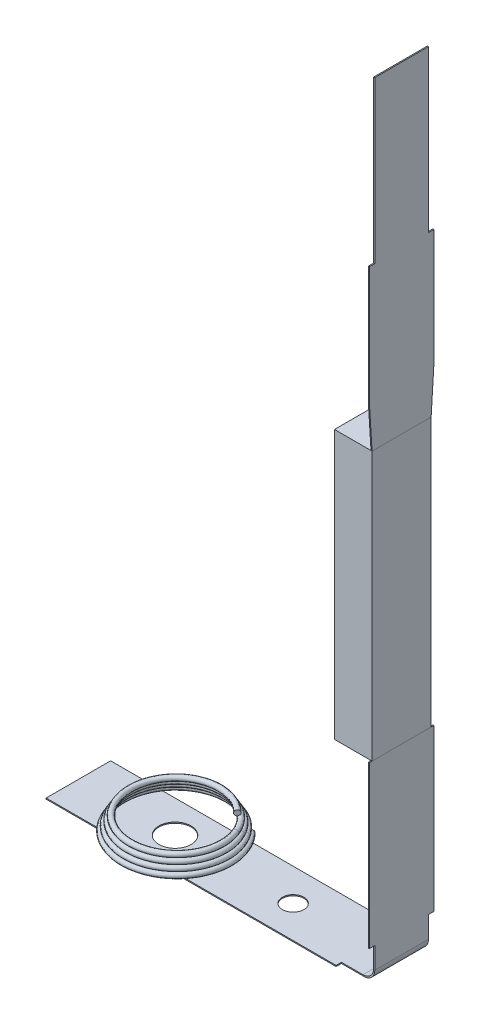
ISO-10303-21;
HEADER;
FILE_DESCRIPTION(('STEP AP214'),'2;1');
FILE_NAME('part.step','',(''),(''),'','','');
FILE_SCHEMA(('AUTOMOTIVE_DESIGN { 1 0 10303 214 1 1 1 1 }'));
ENDSEC;
DATA;
#1=APPLICATION_CONTEXT('core data for automotive mechanical design processes');
#2=APPLICATION_PROTOCOL_DEFINITION('international standard','automotive_design',2000,#1);
#3=PRODUCT_CONTEXT('',#1,'mechanical');
#4=PRODUCT('Part','Part','',(#3));
#5=PRODUCT_RELATED_PRODUCT_CATEGORY('part','',(#4));
#6=PRODUCT_DEFINITION_FORMATION('','',#4);
#7=PRODUCT_DEFINITION_CONTEXT('part definition',#1,'design');
#8=PRODUCT_DEFINITION('design','',#6,#7);
#9=PRODUCT_DEFINITION_SHAPE('','',#8);
#10=(LENGTH_UNIT() NAMED_UNIT(*) SI_UNIT(.MILLI.,.METRE.));
#11=(NAMED_UNIT(*) PLANE_ANGLE_UNIT() SI_UNIT($,.RADIAN.));
#12=(NAMED_UNIT(*) SI_UNIT($,.STERADIAN.) SOLID_ANGLE_UNIT());
#13=UNCERTAINTY_MEASURE_WITH_UNIT(LENGTH_MEASURE(1.E-05),#10,'distance_accuracy_value','');
#14=(GEOMETRIC_REPRESENTATION_CONTEXT(3) GLOBAL_UNCERTAINTY_ASSIGNED_CONTEXT((#13)) GLOBAL_UNIT_ASSIGNED_CONTEXT((#10,
#11,#12)) REPRESENTATION_CONTEXT('',''));
#15=CARTESIAN_POINT('',(0.,0.,0.));
#16=DIRECTION('',(0.,0.,1.));
#17=DIRECTION('',(1.,0.,0.));
#18=AXIS2_PLACEMENT_3D('',#15,#16,#17);
#19=CARTESIAN_POINT('',(21.,47.,-3.));
#20=DIRECTION('',(0.,0.,-1.));
#21=DIRECTION('',(-1.,0.,0.));
#22=AXIS2_PLACEMENT_3D('',#19,#20,#21);
#23=PLANE('',#22);
#24=DIRECTION('',(0.,1.,0.));
#25=VECTOR('',#24,1.);
#26=CARTESIAN_POINT('',(21.1,47.,-3.));
#27=LINE('',#26,#25);
#28=CARTESIAN_POINT('',(21.1,47.,-3.));
#29=VERTEX_POINT('',#28);
#30=CARTESIAN_POINT('',(21.1,58.,-3.));
#31=VERTEX_POINT('',#30);
#32=EDGE_CURVE('E120',#29,#31,#27,.T.);
#33=ORIENTED_EDGE('',*,*,#32,.F.);
#34=DIRECTION('',(1.,0.,0.));
#35=VECTOR('',#34,1.);
#36=CARTESIAN_POINT('',(21.,47.,-3.));
#37=LINE('',#36,#35);
#38=CARTESIAN_POINT('',(21.,47.,-3.));
#39=VERTEX_POINT('',#38);
#40=EDGE_CURVE('E12',#39,#29,#37,.T.);
#41=ORIENTED_EDGE('',*,*,#40,.F.);
#42=DIRECTION('',(0.,1.,0.));
#43=VECTOR('',#42,1.);
#44=CARTESIAN_POINT('',(21.,47.,-3.));
#45=LINE('',#44,#43);
#46=CARTESIAN_POINT('',(21.,58.,-3.));
#47=VERTEX_POINT('',#46);
#48=EDGE_CURVE('E122',#39,#47,#45,.T.);
#49=ORIENTED_EDGE('',*,*,#48,.T.);
#50=DIRECTION('',(1.,0.,0.));
#51=VECTOR('',#50,1.);
#52=CARTESIAN_POINT('',(21.,58.,-3.));
#53=LINE('',#52,#51);
#54=EDGE_CURVE('E47',#47,#31,#53,.T.);
#55=ORIENTED_EDGE('',*,*,#54,.T.);
#56=EDGE_LOOP('',(#33,#41,#49,#55));
#57=FACE_BOUND('',#56,.T.);
#58=ADVANCED_FACE('F44',(#57),#23,.T.);
#59=CARTESIAN_POINT('',(21.,43.,-2.75));
#60=DIRECTION('',(0.,-0.0623782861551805,-0.998052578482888));
#61=DIRECTION('',(0.,0.998052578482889,-0.0623782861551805));
#62=AXIS2_PLACEMENT_3D('',#59,#60,#61);
#63=PLANE('',#62);
#64=DIRECTION('',(0.,0.998052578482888,-0.0623782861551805));
#65=VECTOR('',#64,1.);
#66=CARTESIAN_POINT('',(21.1,43.,-2.75));
#67=LINE('',#66,#65);
#68=CARTESIAN_POINT('',(21.1,43.,-2.75));
#69=VERTEX_POINT('',#68);
#70=EDGE_CURVE('E138',#69,#29,#67,.T.);
#71=ORIENTED_EDGE('',*,*,#70,.F.);
#72=DIRECTION('',(1.,0.,0.));
#73=VECTOR('',#72,1.);
#74=CARTESIAN_POINT('',(21.,43.,-2.75));
#75=LINE('',#74,#73);
#76=CARTESIAN_POINT('',(21.,43.,-2.75));
#77=VERTEX_POINT('',#76);
#78=EDGE_CURVE('E52',#77,#69,#75,.T.);
#79=ORIENTED_EDGE('',*,*,#78,.F.);
#80=DIRECTION('',(0.,0.998052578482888,-0.0623782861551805));
#81=VECTOR('',#80,1.);
#82=CARTESIAN_POINT('',(21.,43.,-2.75));
#83=LINE('',#82,#81);
#84=EDGE_CURVE('E127',#77,#39,#83,.T.);
#85=ORIENTED_EDGE('',*,*,#84,.T.);
#86=ORIENTED_EDGE('',*,*,#40,.T.);
#87=EDGE_LOOP('',(#71,#79,#85,#86));
#88=FACE_BOUND('',#87,.T.);
#89=ADVANCED_FACE('F226',(#88),#63,.T.);
#90=CARTESIAN_POINT('',(21.,43.,2.75));
#91=DIRECTION('',(0.,-1.,0.));
#92=DIRECTION('',(0.,0.,-1.));
#93=AXIS2_PLACEMENT_3D('',#90,#91,#92);
#94=PLANE('',#93);
#95=DIRECTION('',(0.,0.,-1.));
#96=VECTOR('',#95,1.);
#97=CARTESIAN_POINT('',(21.1,43.,2.75));
#98=LINE('',#97,#96);
#99=CARTESIAN_POINT('',(21.1,43.,2.75));
#100=VERTEX_POINT('',#99);
#101=EDGE_CURVE('E157',#100,#69,#98,.T.);
#102=ORIENTED_EDGE('',*,*,#101,.F.);
#103=DIRECTION('',(1.,0.,0.));
#104=VECTOR('',#103,1.);
#105=CARTESIAN_POINT('',(21.,43.,2.75));
#106=LINE('',#105,#104);
#107=CARTESIAN_POINT('',(21.,43.,2.75));
#108=VERTEX_POINT('',#107);
#109=EDGE_CURVE('E185',#108,#100,#106,.T.);
#110=ORIENTED_EDGE('',*,*,#109,.F.);
#111=DIRECTION('',(0.,0.,-1.));
#112=VECTOR('',#111,1.);
#113=CARTESIAN_POINT('',(21.,43.,2.75));
#114=LINE('',#113,#112);
#115=EDGE_CURVE('E181',#108,#77,#114,.T.);
#116=ORIENTED_EDGE('',*,*,#115,.T.);
#117=ORIENTED_EDGE('',*,*,#78,.T.);
#118=EDGE_LOOP('',(#102,#110,#116,#117));
#119=FACE_BOUND('',#118,.T.);
#120=ADVANCED_FACE('F222',(#119),#94,.T.);
#121=CARTESIAN_POINT('',(21.,43.,2.75));
#122=DIRECTION('',(0.,-0.0623782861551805,0.998052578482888));
#123=DIRECTION('',(0.,-0.998052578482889,-0.0623782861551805));
#124=AXIS2_PLACEMENT_3D('',#121,#122,#123);
#125=PLANE('',#124);
#126=DIRECTION('',(0.,-0.998052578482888,-0.0623782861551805));
#127=VECTOR('',#126,1.);
#128=CARTESIAN_POINT('',(21.1,43.,2.75));
#129=LINE('',#128,#127);
#130=CARTESIAN_POINT('',(21.1,47.,3.));
#131=VERTEX_POINT('',#130);
#132=EDGE_CURVE('E154',#131,#100,#129,.T.);
#133=ORIENTED_EDGE('',*,*,#132,.F.);
#134=DIRECTION('',(1.,0.,0.));
#135=VECTOR('',#134,1.);
#136=CARTESIAN_POINT('',(21.,47.,3.));
#137=LINE('',#136,#135);
#138=CARTESIAN_POINT('',(21.,47.,3.));
#139=VERTEX_POINT('',#138);
#140=EDGE_CURVE('E187',#139,#131,#137,.T.);
#141=ORIENTED_EDGE('',*,*,#140,.F.);
#142=DIRECTION('',(0.,-0.998052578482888,-0.0623782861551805));
#143=VECTOR('',#142,1.);
#144=CARTESIAN_POINT('',(21.,43.,2.75));
#145=LINE('',#144,#143);
#146=EDGE_CURVE('E178',#139,#108,#145,.T.);
#147=ORIENTED_EDGE('',*,*,#146,.T.);
#148=ORIENTED_EDGE('',*,*,#109,.T.);
#149=EDGE_LOOP('',(#133,#141,#147,#148));
#150=FACE_BOUND('',#149,.T.);
#151=ADVANCED_FACE('F218',(#150),#125,.T.);
#152=CARTESIAN_POINT('',(21.,47.,3.));
#153=DIRECTION('',(0.,0.,1.));
#154=DIRECTION('',(1.,0.,0.));
#155=AXIS2_PLACEMENT_3D('',#152,#153,#154);
#156=PLANE('',#155);
#157=DIRECTION('',(0.,-1.,0.));
#158=VECTOR('',#157,1.);
#159=CARTESIAN_POINT('',(21.1,47.,3.));
#160=LINE('',#159,#158);
#161=CARTESIAN_POINT('',(21.1,58.,3.));
#162=VERTEX_POINT('',#161);
#163=EDGE_CURVE('E151',#162,#131,#160,.T.);
#164=ORIENTED_EDGE('',*,*,#163,.F.);
#165=DIRECTION('',(1.,0.,0.));
#166=VECTOR('',#165,1.);
#167=CARTESIAN_POINT('',(21.,58.,3.));
#168=LINE('',#167,#166);
#169=CARTESIAN_POINT('',(21.,58.,3.));
#170=VERTEX_POINT('',#169);
#171=EDGE_CURVE('E189',#170,#162,#168,.T.);
#172=ORIENTED_EDGE('',*,*,#171,.F.);
#173=DIRECTION('',(0.,-1.,0.));
#174=VECTOR('',#173,1.);
#175=CARTESIAN_POINT('',(21.,47.,3.));
#176=LINE('',#175,#174);
#177=EDGE_CURVE('E175',#170,#139,#176,.T.);
#178=ORIENTED_EDGE('',*,*,#177,.T.);
#179=ORIENTED_EDGE('',*,*,#140,.T.);
#180=EDGE_LOOP('',(#164,#172,#178,#179));
#181=FACE_BOUND('',#180,.T.);
#182=ADVANCED_FACE('F214',(#181),#156,.T.);
#183=CARTESIAN_POINT('',(21.,58.,3.));
#184=DIRECTION('',(0.,1.,0.));
#185=DIRECTION('',(0.,0.,1.));
#186=AXIS2_PLACEMENT_3D('',#183,#184,#185);
#187=PLANE('',#186);
#188=DIRECTION('',(0.,0.,1.));
#189=VECTOR('',#188,1.);
#190=CARTESIAN_POINT('',(21.1,58.,3.));
#191=LINE('',#190,#189);
#192=CARTESIAN_POINT('',(21.1,58.,2.5));
#193=VERTEX_POINT('',#192);
#194=EDGE_CURVE('E148',#193,#162,#191,.T.);
#195=ORIENTED_EDGE('',*,*,#194,.F.);
#196=DIRECTION('',(1.,0.,0.));
#197=VECTOR('',#196,1.);
#198=CARTESIAN_POINT('',(21.,58.,2.5));
#199=LINE('',#198,#197);
#200=CARTESIAN_POINT('',(21.,58.,2.5));
#201=VERTEX_POINT('',#200);
#202=EDGE_CURVE('E191',#201,#193,#199,.T.);
#203=ORIENTED_EDGE('',*,*,#202,.F.);
#204=DIRECTION('',(0.,0.,1.));
#205=VECTOR('',#204,1.);
#206=CARTESIAN_POINT('',(21.,58.,3.));
#207=LINE('',#206,#205);
#208=EDGE_CURVE('E172',#201,#170,#207,.T.);
#209=ORIENTED_EDGE('',*,*,#208,.T.);
#210=ORIENTED_EDGE('',*,*,#171,.T.);
#211=EDGE_LOOP('',(#195,#203,#209,#210));
#212=FACE_BOUND('',#211,.T.);
#213=ADVANCED_FACE('F210',(#212),#187,.T.);
#214=CARTESIAN_POINT('',(21.,58.,2.5));
#215=DIRECTION('',(0.,0.,1.));
#216=DIRECTION('',(1.,0.,0.));
#217=AXIS2_PLACEMENT_3D('',#214,#215,#216);
#218=PLANE('',#217);
#219=DIRECTION('',(0.,-1.,0.));
#220=VECTOR('',#219,1.);
#221=CARTESIAN_POINT('',(21.1,58.,2.5));
#222=LINE('',#221,#220);
#223=CARTESIAN_POINT('',(21.1,73.,2.5));
#224=VERTEX_POINT('',#223);
#225=EDGE_CURVE('E145',#224,#193,#222,.T.);
#226=ORIENTED_EDGE('',*,*,#225,.F.);
#227=DIRECTION('',(1.,0.,0.));
#228=VECTOR('',#227,1.);
#229=CARTESIAN_POINT('',(21.,73.,2.5));
#230=LINE('',#229,#228);
#231=CARTESIAN_POINT('',(21.,73.,2.5));
#232=VERTEX_POINT('',#231);
#233=EDGE_CURVE('E193',#232,#224,#230,.T.);
#234=ORIENTED_EDGE('',*,*,#233,.F.);
#235=DIRECTION('',(0.,-1.,0.));
#236=VECTOR('',#235,1.);
#237=CARTESIAN_POINT('',(21.,58.,2.5));
#238=LINE('',#237,#236);
#239=EDGE_CURVE('E169',#232,#201,#238,.T.);
#240=ORIENTED_EDGE('',*,*,#239,.T.);
#241=ORIENTED_EDGE('',*,*,#202,.T.);
#242=EDGE_LOOP('',(#226,#234,#240,#241));
#243=FACE_BOUND('',#242,.T.);
#244=ADVANCED_FACE('F206',(#243),#218,.T.);
#245=CARTESIAN_POINT('',(21.,73.,2.5));
#246=DIRECTION('',(0.,1.,0.));
#247=DIRECTION('',(0.,0.,1.));
#248=AXIS2_PLACEMENT_3D('',#245,#246,#247);
#249=PLANE('',#248);
#250=DIRECTION('',(0.,0.,1.));
#251=VECTOR('',#250,1.);
#252=CARTESIAN_POINT('',(21.1,73.,2.5));
#253=LINE('',#252,#251);
#254=CARTESIAN_POINT('',(21.1,73.,-2.5));
#255=VERTEX_POINT('',#254);
#256=EDGE_CURVE('E142',#255,#224,#253,.T.);
#257=ORIENTED_EDGE('',*,*,#256,.F.);
#258=DIRECTION('',(1.,0.,0.));
#259=VECTOR('',#258,1.);
#260=CARTESIAN_POINT('',(21.,73.,-2.5));
#261=LINE('',#260,#259);
#262=CARTESIAN_POINT('',(21.,73.,-2.5));
#263=VERTEX_POINT('',#262);
#264=EDGE_CURVE('E195',#263,#255,#261,.T.);
#265=ORIENTED_EDGE('',*,*,#264,.F.);
#266=DIRECTION('',(0.,0.,1.));
#267=VECTOR('',#266,1.);
#268=CARTESIAN_POINT('',(21.,73.,2.5));
#269=LINE('',#268,#267);
#270=EDGE_CURVE('E166',#263,#232,#269,.T.);
#271=ORIENTED_EDGE('',*,*,#270,.T.);
#272=ORIENTED_EDGE('',*,*,#233,.T.);
#273=EDGE_LOOP('',(#257,#265,#271,#272));
#274=FACE_BOUND('',#273,.T.);
#275=ADVANCED_FACE('F202',(#274),#249,.T.);
#276=CARTESIAN_POINT('',(21.,58.,-2.5));
#277=DIRECTION('',(0.,0.,-1.));
#278=DIRECTION('',(-1.,0.,0.));
#279=AXIS2_PLACEMENT_3D('',#276,#277,#278);
#280=PLANE('',#279);
#281=DIRECTION('',(0.,1.,0.));
#282=VECTOR('',#281,1.);
#283=CARTESIAN_POINT('',(21.1,58.,-2.5));
#284=LINE('',#283,#282);
#285=CARTESIAN_POINT('',(21.1,58.,-2.5));
#286=VERTEX_POINT('',#285);
#287=EDGE_CURVE('E134',#286,#255,#284,.T.);
#288=ORIENTED_EDGE('',*,*,#287,.F.);
#289=DIRECTION('',(1.,0.,0.));
#290=VECTOR('',#289,1.);
#291=CARTESIAN_POINT('',(21.,58.,-2.5));
#292=LINE('',#291,#290);
#293=CARTESIAN_POINT('',(21.,58.,-2.5));
#294=VERTEX_POINT('',#293);
#295=EDGE_CURVE('E126',#294,#286,#292,.T.);
#296=ORIENTED_EDGE('',*,*,#295,.F.);
#297=DIRECTION('',(0.,1.,0.));
#298=VECTOR('',#297,1.);
#299=CARTESIAN_POINT('',(21.,58.,-2.5));
#300=LINE('',#299,#298);
#301=EDGE_CURVE('E163',#294,#263,#300,.T.);
#302=ORIENTED_EDGE('',*,*,#301,.T.);
#303=ORIENTED_EDGE('',*,*,#264,.T.);
#304=EDGE_LOOP('',(#288,#296,#302,#303));
#305=FACE_BOUND('',#304,.T.);
#306=ADVANCED_FACE('F198',(#305),#280,.T.);
#307=CARTESIAN_POINT('',(21.,58.,-2.5));
#308=DIRECTION('',(0.,1.,0.));
#309=DIRECTION('',(0.,0.,1.));
#310=AXIS2_PLACEMENT_3D('',#307,#308,#309);
#311=PLANE('',#310);
#312=DIRECTION('',(0.,0.,1.));
#313=VECTOR('',#312,1.);
#314=CARTESIAN_POINT('',(21.1,58.,-2.5));
#315=LINE('',#314,#313);
#316=EDGE_CURVE('E129',#31,#286,#315,.T.);
#317=ORIENTED_EDGE('',*,*,#316,.F.);
#318=ORIENTED_EDGE('',*,*,#54,.F.);
#319=DIRECTION('',(0.,0.,1.));
#320=VECTOR('',#319,1.);
#321=CARTESIAN_POINT('',(21.,58.,-2.5));
#322=LINE('',#321,#320);
#323=EDGE_CURVE('E161',#47,#294,#322,.T.);
#324=ORIENTED_EDGE('',*,*,#323,.T.);
#325=ORIENTED_EDGE('',*,*,#295,.T.);
#326=EDGE_LOOP('',(#317,#318,#324,#325));
#327=FACE_BOUND('',#326,.T.);
#328=ADVANCED_FACE('F130',(#327),#311,.T.);
#329=CARTESIAN_POINT('',(21.,58.,-3.));
#330=DIRECTION('',(-1.,0.,0.));
#331=DIRECTION('',(0.,0.,1.));
#332=AXIS2_PLACEMENT_3D('',#329,#330,#331);
#333=PLANE('',#332);
#334=ORIENTED_EDGE('',*,*,#48,.F.);
#335=ORIENTED_EDGE('',*,*,#84,.F.);
#336=ORIENTED_EDGE('',*,*,#115,.F.);
#337=ORIENTED_EDGE('',*,*,#146,.F.);
#338=ORIENTED_EDGE('',*,*,#177,.F.);
#339=ORIENTED_EDGE('',*,*,#208,.F.);
#340=ORIENTED_EDGE('',*,*,#239,.F.);
#341=ORIENTED_EDGE('',*,*,#270,.F.);
#342=ORIENTED_EDGE('',*,*,#301,.F.);
#343=ORIENTED_EDGE('',*,*,#323,.F.);
#344=EDGE_LOOP('',(#334,#335,#336,#337,#338,#339,#340,#341,#342,#343));
#345=FACE_BOUND('',#344,.T.);
#346=ADVANCED_FACE('F225',(#345),#333,.T.);
#347=CARTESIAN_POINT('',(21.1,58.,-3.));
#348=DIRECTION('',(-1.,0.,0.));
#349=DIRECTION('',(0.,0.,1.));
#350=AXIS2_PLACEMENT_3D('',#347,#348,#349);
#351=PLANE('',#350);
#352=ORIENTED_EDGE('',*,*,#32,.T.);
#353=ORIENTED_EDGE('',*,*,#316,.T.);
#354=ORIENTED_EDGE('',*,*,#287,.T.);
#355=ORIENTED_EDGE('',*,*,#256,.T.);
#356=ORIENTED_EDGE('',*,*,#225,.T.);
#357=ORIENTED_EDGE('',*,*,#194,.T.);
#358=ORIENTED_EDGE('',*,*,#163,.T.);
#359=ORIENTED_EDGE('',*,*,#132,.T.);
#360=ORIENTED_EDGE('',*,*,#101,.T.);
#361=ORIENTED_EDGE('',*,*,#70,.T.);
#362=EDGE_LOOP('',(#352,#353,#354,#355,#356,#357,#358,#359,#360,#361));
#363=FACE_BOUND('',#362,.T.);
#364=ADVANCED_FACE('F136',(#363),#351,.F.);
#365=CLOSED_SHELL('',(#58,#89,#120,#151,#182,#213,#244,#275,#306,#328,#346,#364));
#366=MANIFOLD_SOLID_BREP('B2',#365);
#367=CARTESIAN_POINT('',(17.6,18.,2.75));
#368=DIRECTION('',(0.,0.,1.));
#369=DIRECTION('',(1.,0.,0.));
#370=AXIS2_PLACEMENT_3D('',#367,#368,#369);
#371=PLANE('',#370);
#372=DIRECTION('',(0.,-1.,0.));
#373=VECTOR('',#372,1.);
#374=CARTESIAN_POINT('',(21.1,18.,2.75));
#375=LINE('',#374,#373);
#376=CARTESIAN_POINT('',(21.1,43.,2.75));
#377=VERTEX_POINT('',#376);
#378=CARTESIAN_POINT('',(21.1,18.,2.75));
#379=VERTEX_POINT('',#378);
#380=EDGE_CURVE('E373',#377,#379,#375,.T.);
#381=ORIENTED_EDGE('',*,*,#380,.F.);
#382=DIRECTION('',(1.,0.,0.));
#383=VECTOR('',#382,1.);
#384=CARTESIAN_POINT('',(17.6,43.,2.75));
#385=LINE('',#384,#383);
#386=CARTESIAN_POINT('',(17.6,43.,2.75));
#387=VERTEX_POINT('',#386);
#388=EDGE_CURVE('E42',#387,#377,#385,.T.);
#389=ORIENTED_EDGE('',*,*,#388,.F.);
#390=DIRECTION('',(0.,-1.,0.));
#391=VECTOR('',#390,1.);
#392=CARTESIAN_POINT('',(17.6,18.,2.75));
#393=LINE('',#392,#391);
#394=CARTESIAN_POINT('',(17.6,18.,2.75));
#395=VERTEX_POINT('',#394);
#396=EDGE_CURVE('E375',#387,#395,#393,.T.);
#397=ORIENTED_EDGE('',*,*,#396,.T.);
#398=DIRECTION('',(1.,0.,0.));
#399=VECTOR('',#398,1.);
#400=CARTESIAN_POINT('',(17.6,18.,2.75));
#401=LINE('',#400,#399);
#402=EDGE_CURVE('E336',#395,#379,#401,.T.);
#403=ORIENTED_EDGE('',*,*,#402,.T.);
#404=EDGE_LOOP('',(#381,#389,#397,#403));
#405=FACE_BOUND('',#404,.T.);
#406=ADVANCED_FACE('F333',(#405),#371,.T.);
#407=CARTESIAN_POINT('',(17.6,43.,2.75));
#408=DIRECTION('',(0.,1.,0.));
#409=DIRECTION('',(0.,0.,1.));
#410=AXIS2_PLACEMENT_3D('',#407,#408,#409);
#411=PLANE('',#410);
#412=DIRECTION('',(0.,0.,1.));
#413=VECTOR('',#412,1.);
#414=CARTESIAN_POINT('',(21.1,43.,2.75));
#415=LINE('',#414,#413);
#416=CARTESIAN_POINT('',(21.1,43.,-2.75));
#417=VERTEX_POINT('',#416);
#418=EDGE_CURVE('E390',#417,#377,#415,.T.);
#419=ORIENTED_EDGE('',*,*,#418,.F.);
#420=DIRECTION('',(1.,0.,0.));
#421=VECTOR('',#420,1.);
#422=CARTESIAN_POINT('',(17.6,43.,-2.75));
#423=LINE('',#422,#421);
#424=CARTESIAN_POINT('',(17.6,43.,-2.75));
#425=VERTEX_POINT('',#424);
#426=EDGE_CURVE('E341',#425,#417,#423,.T.);
#427=ORIENTED_EDGE('',*,*,#426,.F.);
#428=DIRECTION('',(0.,0.,1.));
#429=VECTOR('',#428,1.);
#430=CARTESIAN_POINT('',(17.6,43.,2.75));
#431=LINE('',#430,#429);
#432=EDGE_CURVE('E380',#425,#387,#431,.T.);
#433=ORIENTED_EDGE('',*,*,#432,.T.);
#434=ORIENTED_EDGE('',*,*,#388,.T.);
#435=EDGE_LOOP('',(#419,#427,#433,#434));
#436=FACE_BOUND('',#435,.T.);
#437=ADVANCED_FACE('F405',(#436),#411,.T.);
#438=CARTESIAN_POINT('',(17.6,18.,-2.75));
#439=DIRECTION('',(0.,0.,-1.));
#440=DIRECTION('',(-1.,0.,0.));
#441=AXIS2_PLACEMENT_3D('',#438,#439,#440);
#442=PLANE('',#441);
#443=DIRECTION('',(0.,1.,0.));
#444=VECTOR('',#443,1.);
#445=CARTESIAN_POINT('',(21.1,18.,-2.75));
#446=LINE('',#445,#444);
#447=CARTESIAN_POINT('',(21.1,18.,-2.75));
#448=VERTEX_POINT('',#447);
#449=EDGE_CURVE('E387',#448,#417,#446,.T.);
#450=ORIENTED_EDGE('',*,*,#449,.F.);
#451=DIRECTION('',(1.,0.,0.));
#452=VECTOR('',#451,1.);
#453=CARTESIAN_POINT('',(17.6,18.,-2.75));
#454=LINE('',#453,#452);
#455=CARTESIAN_POINT('',(17.6,18.,-2.75));
#456=VERTEX_POINT('',#455);
#457=EDGE_CURVE('E379',#456,#448,#454,.T.);
#458=ORIENTED_EDGE('',*,*,#457,.F.);
#459=DIRECTION('',(0.,1.,0.));
#460=VECTOR('',#459,1.);
#461=CARTESIAN_POINT('',(17.6,18.,-2.75));
#462=LINE('',#461,#460);
#463=EDGE_CURVE('E398',#456,#425,#462,.T.);
#464=ORIENTED_EDGE('',*,*,#463,.T.);
#465=ORIENTED_EDGE('',*,*,#426,.T.);
#466=EDGE_LOOP('',(#450,#458,#464,#465));
#467=FACE_BOUND('',#466,.T.);
#468=ADVANCED_FACE('F402',(#467),#442,.T.);
#469=CARTESIAN_POINT('',(17.6,18.,2.75));
#470=DIRECTION('',(0.,-1.,0.));
#471=DIRECTION('',(0.,0.,-1.));
#472=AXIS2_PLACEMENT_3D('',#469,#470,#471);
#473=PLANE('',#472);
#474=DIRECTION('',(0.,0.,-1.));
#475=VECTOR('',#474,1.);
#476=CARTESIAN_POINT('',(21.1,18.,2.75));
#477=LINE('',#476,#475);
#478=EDGE_CURVE('E382',#379,#448,#477,.T.);
#479=ORIENTED_EDGE('',*,*,#478,.F.);
#480=ORIENTED_EDGE('',*,*,#402,.F.);
#481=DIRECTION('',(0.,0.,-1.));
#482=VECTOR('',#481,1.);
#483=CARTESIAN_POINT('',(17.6,18.,2.75));
#484=LINE('',#483,#482);
#485=EDGE_CURVE('E396',#395,#456,#484,.T.);
#486=ORIENTED_EDGE('',*,*,#485,.T.);
#487=ORIENTED_EDGE('',*,*,#457,.T.);
#488=EDGE_LOOP('',(#479,#480,#486,#487));
#489=FACE_BOUND('',#488,.T.);
#490=ADVANCED_FACE('F383',(#489),#473,.T.);
#491=CARTESIAN_POINT('',(17.6,43.,2.75));
#492=DIRECTION('',(-1.,0.,0.));
#493=DIRECTION('',(0.,0.,1.));
#494=AXIS2_PLACEMENT_3D('',#491,#492,#493);
#495=PLANE('',#494);
#496=ORIENTED_EDGE('',*,*,#396,.F.);
#497=ORIENTED_EDGE('',*,*,#432,.F.);
#498=ORIENTED_EDGE('',*,*,#463,.F.);
#499=ORIENTED_EDGE('',*,*,#485,.F.);
#500=EDGE_LOOP('',(#496,#497,#498,#499));
#501=FACE_BOUND('',#500,.T.);
#502=ADVANCED_FACE('F407',(#501),#495,.T.);
#503=CARTESIAN_POINT('',(21.1,43.,2.75));
#504=DIRECTION('',(-1.,0.,0.));
#505=DIRECTION('',(0.,0.,1.));
#506=AXIS2_PLACEMENT_3D('',#503,#504,#505);
#507=PLANE('',#506);
#508=ORIENTED_EDGE('',*,*,#380,.T.);
#509=ORIENTED_EDGE('',*,*,#478,.T.);
#510=ORIENTED_EDGE('',*,*,#449,.T.);
#511=ORIENTED_EDGE('',*,*,#418,.T.);
#512=EDGE_LOOP('',(#508,#509,#510,#511));
#513=FACE_BOUND('',#512,.T.);
#514=ADVANCED_FACE('F389',(#513),#507,.F.);
#515=CLOSED_SHELL('',(#406,#437,#468,#490,#502,#514));
#516=MANIFOLD_SOLID_BREP('B6',#515);
#517=CARTESIAN_POINT('',(-9.,0.1,3.));
#518=DIRECTION('',(0.,1.,0.));
#519=DIRECTION('',(0.,0.,1.));
#520=AXIS2_PLACEMENT_3D('',#517,#518,#519);
#521=PLANE('',#520);
#522=CARTESIAN_POINT('',(3.85420599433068,0.1,-3.));
#523=CARTESIAN_POINT('',(3.90589901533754,0.0999999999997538,-2.93472869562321));
#524=CARTESIAN_POINT('',(3.95592881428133,0.0999999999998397,-2.86815682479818));
#525=CARTESIAN_POINT('',(4.0527065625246,0.100000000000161,-2.73245054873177));
#526=CARTESIAN_POINT('',(4.0994471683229,0.100000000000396,-2.66331090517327));
#527=CARTESIAN_POINT('',(4.22299592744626,0.100000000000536,-2.4704534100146));
#528=CARTESIAN_POINT('',(4.29626481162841,0.100000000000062,-2.34444582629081));
#529=CARTESIAN_POINT('',(4.43191317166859,0.0999999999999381,-2.08669250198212));
#530=CARTESIAN_POINT('',(4.49429049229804,0.100000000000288,-1.95494563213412));
#531=CARTESIAN_POINT('',(4.60786853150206,0.0999999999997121,-1.68679124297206));
#532=CARTESIAN_POINT('',(4.65907404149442,0.0999999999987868,-1.55038575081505));
#533=CARTESIAN_POINT('',(4.75014070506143,0.100000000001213,-1.27391994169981));
#534=CARTESIAN_POINT('',(4.79000864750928,0.100000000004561,-1.13386186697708));
#535=CARTESIAN_POINT('',(4.84032747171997,0.100000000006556,-0.926253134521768));
#536=CARTESIAN_POINT('',(4.85515113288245,0.100000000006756,-0.859730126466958));
#537=CARTESIAN_POINT('',(4.88383473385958,0.100000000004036,-0.719229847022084));
#538=CARTESIAN_POINT('',(4.89743299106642,0.100000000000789,-0.64519861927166));
#539=CARTESIAN_POINT('',(4.91680939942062,0.0999999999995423,-0.527896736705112));
#540=CARTESIAN_POINT('',(4.92347294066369,0.0999999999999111,-0.484768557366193));
#541=CARTESIAN_POINT('',(4.9360107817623,0.100000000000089,-0.398397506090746));
#542=CARTESIAN_POINT('',(4.94188507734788,0.099999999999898,-0.355154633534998));
#543=CARTESIAN_POINT('',(4.95120724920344,0.10000000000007,-0.283172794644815));
#544=CARTESIAN_POINT('',(4.95480613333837,0.100000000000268,-0.254452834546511));
#545=CARTESIAN_POINT('',(4.96192015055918,0.099999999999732,-0.19700268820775));
#546=CARTESIAN_POINT('',(4.96543528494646,0.099999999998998,-0.168272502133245));
#547=CARTESIAN_POINT('',(4.9709480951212,0.100000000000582,-0.125522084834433));
#548=CARTESIAN_POINT('',(4.97280379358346,0.100000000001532,-0.111483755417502));
#549=CARTESIAN_POINT('',(4.97675486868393,0.099999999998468,-0.0834418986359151));
#550=CARTESIAN_POINT('',(4.97885019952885,0.0999999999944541,-0.0694383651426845));
#551=CARTESIAN_POINT('',(4.98297576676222,0.100000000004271,-0.0456358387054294));
#552=CARTESIAN_POINT('',(4.98484417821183,0.100000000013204,-0.0358106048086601));
#553=CARTESIAN_POINT('',(4.98835702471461,0.0999999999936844,-0.0214399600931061));
#554=CARTESIAN_POINT('',(4.989610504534,0.099999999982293,-0.0168121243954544));
#555=CARTESIAN_POINT('',(4.99178373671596,0.100000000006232,-0.01071609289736));
#556=CARTESIAN_POINT('',(4.99239325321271,0.100000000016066,-0.00914402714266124));
#557=CARTESIAN_POINT('',(4.99368876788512,0.100000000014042,-0.00627208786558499));
#558=CARTESIAN_POINT('',(4.99435463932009,0.100000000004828,-0.0049633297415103));
#559=CARTESIAN_POINT('',(4.99571964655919,0.0999999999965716,-0.00284870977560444));
#560=CARTESIAN_POINT('',(4.99635317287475,0.0999999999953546,-0.00200705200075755));
#561=CARTESIAN_POINT('',(4.99748825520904,0.100000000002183,-0.000976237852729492));
#562=CARTESIAN_POINT('',(4.99788171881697,0.10000000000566,-0.000677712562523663));
#563=CARTESIAN_POINT('',(4.99868119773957,0.100000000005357,-0.0002530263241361));
#564=CARTESIAN_POINT('',(4.99907560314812,0.100000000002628,-0.000107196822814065));
#565=CARTESIAN_POINT('',(4.99989651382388,0.100000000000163,2.41238963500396E-05));
#566=CARTESIAN_POINT('',(5.00032322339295,0.100000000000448,8.49214145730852E-06));
#567=CARTESIAN_POINT('',(5.00116642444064,0.0999999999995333,-0.000182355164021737));
#568=CARTESIAN_POINT('',(5.00157994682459,0.099999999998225,-0.000369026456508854));
#569=CARTESIAN_POINT('',(5.00259270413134,0.100000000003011,-0.000987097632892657));
#570=CARTESIAN_POINT('',(5.00313698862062,0.100000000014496,-0.00149870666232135));
#571=CARTESIAN_POINT('',(5.00436268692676,0.10000000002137,-0.0028808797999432));
#572=CARTESIAN_POINT('',(5.00497724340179,0.100000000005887,-0.0038032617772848));
#573=CARTESIAN_POINT('',(5.00609195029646,0.0999999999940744,-0.00571827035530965));
#574=CARTESIAN_POINT('',(5.00659132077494,0.0999999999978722,-0.00671131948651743));
#575=CARTESIAN_POINT('',(5.00810010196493,0.100000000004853,-0.00999016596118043));
#576=CARTESIAN_POINT('',(5.00896662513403,0.100000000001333,-0.0123399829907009));
#577=CARTESIAN_POINT('',(5.01054066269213,0.0999999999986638,-0.0170932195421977));
#578=CARTESIAN_POINT('',(5.01124775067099,0.0999999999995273,-0.0194967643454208));
#579=CARTESIAN_POINT('',(5.01321838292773,0.100000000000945,-0.0267451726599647));
#580=CARTESIAN_POINT('',(5.01433234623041,0.100000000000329,-0.0316307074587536));
#581=CARTESIAN_POINT('',(5.01736487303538,0.0999999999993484,-0.046255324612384));
#582=CARTESIAN_POINT('',(5.01899922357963,0.0999999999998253,-0.0560489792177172));
#583=CARTESIAN_POINT('',(5.02189978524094,0.100000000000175,-0.0756925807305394));
#584=CARTESIAN_POINT('',(5.02316579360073,0.100000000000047,-0.0855425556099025));
#585=CARTESIAN_POINT('',(5.0254448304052,0.0999999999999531,-0.105259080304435));
#586=CARTESIAN_POINT('',(5.02645817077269,0.099999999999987,-0.115125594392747));
#587=CARTESIAN_POINT('',(5.02829434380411,0.100000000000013,-0.134872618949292));
#588=CARTESIAN_POINT('',(5.02911723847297,0.100000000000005,-0.144753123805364));
#589=CARTESIAN_POINT('',(5.03285941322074,0.0999999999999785,-0.194191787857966));
#590=CARTESIAN_POINT('',(5.03465957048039,0.0999999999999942,-0.233835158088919));
#591=CARTESIAN_POINT('',(5.03669391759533,0.100000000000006,-0.313170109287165));
#592=CARTESIAN_POINT('',(5.03692729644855,0.100000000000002,-0.352861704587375));
#593=CARTESIAN_POINT('',(5.03605380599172,0.0999999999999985,-0.432268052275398));
#594=CARTESIAN_POINT('',(5.03494567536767,0.0999999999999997,-0.471982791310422));
#595=CARTESIAN_POINT('',(5.03152290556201,0.1,-0.551351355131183));
#596=CARTESIAN_POINT('',(5.02920846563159,0.0999999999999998,-0.591005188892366));
#597=CARTESIAN_POINT('',(5.02165707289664,0.1,-0.694883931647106));
#598=CARTESIAN_POINT('',(5.01549772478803,0.100000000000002,-0.75904361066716));
#599=CARTESIAN_POINT('',(5.00040566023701,0.0999999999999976,-0.887031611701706));
#600=CARTESIAN_POINT('',(4.99147287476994,0.0999999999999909,-0.950859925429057));
#601=CARTESIAN_POINT('',(4.96069833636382,0.100000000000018,-1.1417545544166));
#602=CARTESIAN_POINT('',(4.93488374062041,0.1000000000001,-1.26818718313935));
#603=CARTESIAN_POINT('',(4.84192135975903,0.100000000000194,-1.64651889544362));
#604=CARTESIAN_POINT('',(4.75947791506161,0.100000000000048,-1.89477511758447));
#605=CARTESIAN_POINT('',(4.55758265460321,0.0999999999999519,-2.37578141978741));
#606=CARTESIAN_POINT('',(4.43812624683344,0.100000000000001,-2.60852957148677));
#607=CARTESIAN_POINT('',(4.26652935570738,0.100000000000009,-2.88776151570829));
#608=CARTESIAN_POINT('',(4.23024227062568,0.100000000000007,-2.94426234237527));
#609=CARTESIAN_POINT('',(4.19285355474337,0.1,-2.99999999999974));
#610=B_SPLINE_CURVE_WITH_KNOTS('',3,(#522,#523,#524,#525,#526,#527,#528,#529,#530,#531,#532,
#533,#534,#535,#536,#537,#538,#539,#540,#541,#542,#543,#544,#545,#546,#547,#548,#549,#550,#551,
#552,#553,#554,#555,#556,#557,#558,#559,#560,#561,#562,#563,#564,#565,#566,#567,#568,#569,#570,
#571,#572,#573,#574,#575,#576,#577,#578,#579,#580,#581,#582,#583,#584,#585,#586,#587,#588,#589,
#590,#591,#592,#593,#594,#595,#596,#597,#598,#599,#600,#601,#602,#603,#604,#605,#606,#607,#608,
#609),.UNSPECIFIED.,.F.,.F.,(4,2,2,2,2,2,2,2,2,2,2,2,2,2,2,2,2,2,2,2,2,2,2,2,2,2,2,2,2,2,2,2,2,
2,2,2,2,2,2,2,2,2,2,4),(0.,0.249734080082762,0.50000910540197,0.936722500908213,
1.37352221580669,1.81013422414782,2.24648423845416,2.45091409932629,2.67666132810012,
2.80757455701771,2.93848849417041,3.02532226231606,3.11215468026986,3.15463569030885,
3.19710859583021,3.22709990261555,3.24145732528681,3.24650946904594,3.25090734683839,
3.2540302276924,3.25549752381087,3.25673509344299,3.25798127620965,3.25931755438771,
3.26152601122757,3.26483516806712,3.26816611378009,3.27566151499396,3.28317673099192,
3.29819794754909,3.32797118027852,3.35776077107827,3.38751340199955,3.41725633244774,
3.53625136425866,3.65530798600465,3.77447663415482,3.89362560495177,4.08691893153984,
4.28021706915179,4.66694340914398,5.44835862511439,6.22987082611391,6.43126354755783),.UNSPECIFIED.);
#611=CARTESIAN_POINT('',(3.85420599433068,0.1,-3.));
#612=VERTEX_POINT('',#611);
#613=CARTESIAN_POINT('',(4.19285355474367,0.1,-3.));
#614=VERTEX_POINT('',#613);
#615=EDGE_CURVE('E476',#612,#614,#610,.T.);
#616=ORIENTED_EDGE('',*,*,#615,.F.);
#617=DIRECTION('',(-1.,0.,0.));
#618=VECTOR('',#617,1.);
#619=CARTESIAN_POINT('',(-9.,0.1,-3.));
#620=LINE('',#619,#618);
#621=CARTESIAN_POINT('',(-9.,0.1,-3.));
#622=VERTEX_POINT('',#621);
#623=EDGE_CURVE('E777',#612,#622,#620,.T.);
#624=ORIENTED_EDGE('',*,*,#623,.T.);
#625=DIRECTION('',(0.,0.,1.));
#626=VECTOR('',#625,1.);
#627=CARTESIAN_POINT('',(-9.,0.1,-3.));
#628=LINE('',#627,#626);
#629=CARTESIAN_POINT('',(-9.,0.1,3.));
#630=VERTEX_POINT('',#629);
#631=EDGE_CURVE('E763',#622,#630,#628,.T.);
#632=ORIENTED_EDGE('',*,*,#631,.T.);
#633=DIRECTION('',(1.,0.,0.));
#634=VECTOR('',#633,1.);
#635=CARTESIAN_POINT('',(-9.,0.1,3.));
#636=LINE('',#635,#634);
#637=CARTESIAN_POINT('',(18.,0.1,3.));
#638=VERTEX_POINT('',#637);
#639=EDGE_CURVE('E766',#630,#638,#636,.T.);
#640=ORIENTED_EDGE('',*,*,#639,.T.);
#641=DIRECTION('',(0.,0.,-1.));
#642=VECTOR('',#641,1.);
#643=CARTESIAN_POINT('',(18.,0.1,2.5));
#644=LINE('',#643,#642);
#645=CARTESIAN_POINT('',(18.,0.1,2.5));
#646=VERTEX_POINT('',#645);
#647=EDGE_CURVE('E768',#638,#646,#644,.T.);
#648=ORIENTED_EDGE('',*,*,#647,.T.);
#649=DIRECTION('',(1.,0.,0.));
#650=VECTOR('',#649,1.);
#651=CARTESIAN_POINT('',(18.,0.1,2.5));
#652=LINE('',#651,#650);
#653=CARTESIAN_POINT('',(20.,0.1,2.5));
#654=VERTEX_POINT('',#653);
#655=EDGE_CURVE('E770',#646,#654,#652,.T.);
#656=ORIENTED_EDGE('',*,*,#655,.T.);
#657=DIRECTION('',(0.,0.,-1.));
#658=VECTOR('',#657,1.);
#659=CARTESIAN_POINT('',(20.,0.1,3.));
#660=LINE('',#659,#658);
#661=CARTESIAN_POINT('',(20.,0.1,-2.5));
#662=VERTEX_POINT('',#661);
#663=EDGE_CURVE('E799',#654,#662,#660,.T.);
#664=ORIENTED_EDGE('',*,*,#663,.T.);
#665=DIRECTION('',(-1.,0.,0.));
#666=VECTOR('',#665,1.);
#667=CARTESIAN_POINT('',(18.,0.1,-2.5));
#668=LINE('',#667,#666);
#669=CARTESIAN_POINT('',(18.,0.1,-2.5));
#670=VERTEX_POINT('',#669);
#671=EDGE_CURVE('E773',#662,#670,#668,.T.);
#672=ORIENTED_EDGE('',*,*,#671,.T.);
#673=DIRECTION('',(0.,0.,-1.));
#674=VECTOR('',#673,1.);
#675=CARTESIAN_POINT('',(18.,0.1,-3.));
#676=LINE('',#675,#674);
#677=CARTESIAN_POINT('',(18.,0.1,-3.));
#678=VERTEX_POINT('',#677);
#679=EDGE_CURVE('E775',#670,#678,#676,.T.);
#680=ORIENTED_EDGE('',*,*,#679,.T.);
#681=EDGE_CURVE('E778',#678,#614,#620,.T.);
#682=ORIENTED_EDGE('',*,*,#681,.T.);
#683=EDGE_LOOP('',(#616,#624,#632,#640,#648,#656,#664,#672,#680,#682));
#684=FACE_BOUND('',#683,.T.);
#685=CARTESIAN_POINT('',(0.,0.1,0.));
#686=DIRECTION('',(0.,1.,0.));
#687=DIRECTION('',(0.,0.,1.));
#688=AXIS2_PLACEMENT_3D('',#685,#686,#687);
#689=CIRCLE('',#688,1.5);
#690=CARTESIAN_POINT('',(0.,0.1,1.5));
#691=VERTEX_POINT('',#690);
#692=EDGE_CURVE('E746',#691,#691,#689,.T.);
#693=ORIENTED_EDGE('',*,*,#692,.F.);
#694=EDGE_LOOP('',(#693));
#695=FACE_BOUND('',#694,.T.);
#696=CARTESIAN_POINT('',(11.,0.1,0.));
#697=DIRECTION('',(0.,1.,0.));
#698=DIRECTION('',(0.,0.,1.));
#699=AXIS2_PLACEMENT_3D('',#696,#697,#698);
#700=CIRCLE('',#699,1.);
#701=CARTESIAN_POINT('',(11.,0.1,1.));
#702=VERTEX_POINT('',#701);
#703=EDGE_CURVE('E735',#702,#702,#700,.T.);
#704=ORIENTED_EDGE('',*,*,#703,.F.);
#705=EDGE_LOOP('',(#704));
#706=FACE_BOUND('',#705,.T.);
#707=ADVANCED_FACE('F457',(#684,#695,#706),#521,.T.);
#708=CARTESIAN_POINT('',(-9.,0.,3.));
#709=DIRECTION('',(0.,1.,0.));
#710=DIRECTION('',(0.,0.,1.));
#711=AXIS2_PLACEMENT_3D('',#708,#709,#710);
#712=PLANE('',#711);
#713=CARTESIAN_POINT('',(0.,0.,0.));
#714=DIRECTION('',(0.,1.,0.));
#715=DIRECTION('',(0.,0.,1.));
#716=AXIS2_PLACEMENT_3D('',#713,#714,#715);
#717=CIRCLE('',#716,1.5);
#718=CARTESIAN_POINT('',(0.,0.,1.5));
#719=VERTEX_POINT('',#718);
#720=EDGE_CURVE('E727',#719,#719,#717,.T.);
#721=ORIENTED_EDGE('',*,*,#720,.T.);
#722=EDGE_LOOP('',(#721));
#723=FACE_BOUND('',#722,.T.);
#724=DIRECTION('',(-1.,0.,0.));
#725=VECTOR('',#724,1.);
#726=CARTESIAN_POINT('',(18.,0.,-2.5));
#727=LINE('',#726,#725);
#728=CARTESIAN_POINT('',(20.1,0.,-2.5));
#729=VERTEX_POINT('',#728);
#730=CARTESIAN_POINT('',(18.,0.,-2.5));
#731=VERTEX_POINT('',#730);
#732=EDGE_CURVE('E730',#729,#731,#727,.T.);
#733=ORIENTED_EDGE('',*,*,#732,.F.);
#734=DIRECTION('',(0.,0.,-1.));
#735=VECTOR('',#734,1.);
#736=CARTESIAN_POINT('',(20.1,0.,2.5));
#737=LINE('',#736,#735);
#738=CARTESIAN_POINT('',(20.1,0.,2.5));
#739=VERTEX_POINT('',#738);
#740=EDGE_CURVE('E483',#729,#739,#737,.F.);
#741=ORIENTED_EDGE('',*,*,#740,.T.);
#742=DIRECTION('',(1.,0.,0.));
#743=VECTOR('',#742,1.);
#744=CARTESIAN_POINT('',(18.,0.,2.5));
#745=LINE('',#744,#743);
#746=CARTESIAN_POINT('',(18.,0.,2.5));
#747=VERTEX_POINT('',#746);
#748=EDGE_CURVE('E756',#747,#739,#745,.T.);
#749=ORIENTED_EDGE('',*,*,#748,.F.);
#750=DIRECTION('',(0.,0.,-1.));
#751=VECTOR('',#750,1.);
#752=CARTESIAN_POINT('',(18.,0.,2.5));
#753=LINE('',#752,#751);
#754=CARTESIAN_POINT('',(18.,0.,3.));
#755=VERTEX_POINT('',#754);
#756=EDGE_CURVE('E754',#755,#747,#753,.T.);
#757=ORIENTED_EDGE('',*,*,#756,.F.);
#758=DIRECTION('',(1.,0.,0.));
#759=VECTOR('',#758,1.);
#760=CARTESIAN_POINT('',(-9.,0.,3.));
#761=LINE('',#760,#759);
#762=CARTESIAN_POINT('',(-9.,0.,3.));
#763=VERTEX_POINT('',#762);
#764=EDGE_CURVE('E752',#763,#755,#761,.T.);
#765=ORIENTED_EDGE('',*,*,#764,.F.);
#766=DIRECTION('',(0.,0.,1.));
#767=VECTOR('',#766,1.);
#768=CARTESIAN_POINT('',(-9.,0.,-3.));
#769=LINE('',#768,#767);
#770=CARTESIAN_POINT('',(-9.,0.,-3.));
#771=VERTEX_POINT('',#770);
#772=EDGE_CURVE('E749',#771,#763,#769,.T.);
#773=ORIENTED_EDGE('',*,*,#772,.F.);
#774=DIRECTION('',(-1.,0.,0.));
#775=VECTOR('',#774,1.);
#776=CARTESIAN_POINT('',(-9.,0.,-3.));
#777=LINE('',#776,#775);
#778=CARTESIAN_POINT('',(18.,0.,-3.));
#779=VERTEX_POINT('',#778);
#780=EDGE_CURVE('E761',#779,#771,#777,.T.);
#781=ORIENTED_EDGE('',*,*,#780,.F.);
#782=DIRECTION('',(0.,0.,-1.));
#783=VECTOR('',#782,1.);
#784=CARTESIAN_POINT('',(18.,0.,-3.));
#785=LINE('',#784,#783);
#786=EDGE_CURVE('E759',#731,#779,#785,.T.);
#787=ORIENTED_EDGE('',*,*,#786,.F.);
#788=EDGE_LOOP('',(#733,#741,#749,#757,#765,#773,#781,#787));
#789=FACE_BOUND('',#788,.T.);
#790=CARTESIAN_POINT('',(11.,0.,0.));
#791=DIRECTION('',(0.,1.,0.));
#792=DIRECTION('',(0.,0.,1.));
#793=AXIS2_PLACEMENT_3D('',#790,#791,#792);
#794=CIRCLE('',#793,1.);
#795=CARTESIAN_POINT('',(11.,0.,1.));
#796=VERTEX_POINT('',#795);
#797=EDGE_CURVE('E733',#796,#796,#794,.T.);
#798=ORIENTED_EDGE('',*,*,#797,.T.);
#799=EDGE_LOOP('',(#798));
#800=FACE_BOUND('',#799,.T.);
#801=ADVANCED_FACE('F715',(#723,#789,#800),#712,.F.);
#802=CARTESIAN_POINT('',(-9.,0.1,-3.));
#803=DIRECTION('',(1.,0.,0.));
#804=DIRECTION('',(0.,0.,-1.));
#805=AXIS2_PLACEMENT_3D('',#802,#803,#804);
#806=PLANE('',#805);
#807=ORIENTED_EDGE('',*,*,#772,.T.);
#808=DIRECTION('',(0.,-1.,0.));
#809=VECTOR('',#808,1.);
#810=CARTESIAN_POINT('',(-9.,0.1,3.));
#811=LINE('',#810,#809);
#812=EDGE_CURVE('E796',#630,#763,#811,.T.);
#813=ORIENTED_EDGE('',*,*,#812,.F.);
#814=ORIENTED_EDGE('',*,*,#631,.F.);
#815=DIRECTION('',(0.,-1.,0.));
#816=VECTOR('',#815,1.);
#817=CARTESIAN_POINT('',(-9.,0.1,-3.));
#818=LINE('',#817,#816);
#819=EDGE_CURVE('E781',#622,#771,#818,.T.);
#820=ORIENTED_EDGE('',*,*,#819,.T.);
#821=EDGE_LOOP('',(#807,#813,#814,#820));
#822=FACE_BOUND('',#821,.T.);
#823=ADVANCED_FACE('F459',(#822),#806,.F.);
#824=CARTESIAN_POINT('',(-9.,0.1,3.));
#825=DIRECTION('',(0.,0.,-1.));
#826=DIRECTION('',(-1.,0.,0.));
#827=AXIS2_PLACEMENT_3D('',#824,#825,#826);
#828=PLANE('',#827);
#829=ORIENTED_EDGE('',*,*,#764,.T.);
#830=DIRECTION('',(0.,-1.,0.));
#831=VECTOR('',#830,1.);
#832=CARTESIAN_POINT('',(18.,0.1,3.));
#833=LINE('',#832,#831);
#834=EDGE_CURVE('E793',#638,#755,#833,.T.);
#835=ORIENTED_EDGE('',*,*,#834,.F.);
#836=ORIENTED_EDGE('',*,*,#639,.F.);
#837=ORIENTED_EDGE('',*,*,#812,.T.);
#838=EDGE_LOOP('',(#829,#835,#836,#837));
#839=FACE_BOUND('',#838,.T.);
#840=ADVANCED_FACE('F722',(#839),#828,.F.);
#841=CARTESIAN_POINT('',(18.,0.1,2.5));
#842=DIRECTION('',(-1.,0.,0.));
#843=DIRECTION('',(0.,0.,1.));
#844=AXIS2_PLACEMENT_3D('',#841,#842,#843);
#845=PLANE('',#844);
#846=ORIENTED_EDGE('',*,*,#756,.T.);
#847=DIRECTION('',(0.,-1.,0.));
#848=VECTOR('',#847,1.);
#849=CARTESIAN_POINT('',(18.,0.1,2.5));
#850=LINE('',#849,#848);
#851=EDGE_CURVE('E790',#646,#747,#850,.T.);
#852=ORIENTED_EDGE('',*,*,#851,.F.);
#853=ORIENTED_EDGE('',*,*,#647,.F.);
#854=ORIENTED_EDGE('',*,*,#834,.T.);
#855=EDGE_LOOP('',(#846,#852,#853,#854));
#856=FACE_BOUND('',#855,.T.);
#857=ADVANCED_FACE('F890',(#856),#845,.F.);
#858=CARTESIAN_POINT('',(18.,0.1,2.5));
#859=DIRECTION('',(0.,0.,-1.));
#860=DIRECTION('',(-1.,0.,0.));
#861=AXIS2_PLACEMENT_3D('',#858,#859,#860);
#862=PLANE('',#861);
#863=ORIENTED_EDGE('',*,*,#748,.T.);
#864=CARTESIAN_POINT('',(20.1,1.,2.5));
#865=DIRECTION('',(0.,0.,-1.));
#866=DIRECTION('',(-1.,0.,0.));
#867=AXIS2_PLACEMENT_3D('',#864,#865,#866);
#868=CIRCLE('',#867,1.);
#869=CARTESIAN_POINT('',(21.1,1.,2.5));
#870=VERTEX_POINT('',#869);
#871=EDGE_CURVE('E470',#739,#870,#868,.F.);
#872=ORIENTED_EDGE('',*,*,#871,.T.);
#873=DIRECTION('',(0.,-1.,0.));
#874=VECTOR('',#873,1.);
#875=CARTESIAN_POINT('',(21.1,0.,2.5));
#876=LINE('',#875,#874);
#877=CARTESIAN_POINT('',(21.1,3.,2.5));
#878=VERTEX_POINT('',#877);
#879=EDGE_CURVE('E819',#878,#870,#876,.T.);
#880=ORIENTED_EDGE('',*,*,#879,.F.);
#881=DIRECTION('',(-1.,0.,0.));
#882=VECTOR('',#881,1.);
#883=CARTESIAN_POINT('',(21.1,3.,2.5));
#884=LINE('',#883,#882);
#885=CARTESIAN_POINT('',(21.,3.,2.5));
#886=VERTEX_POINT('',#885);
#887=EDGE_CURVE('E845',#878,#886,#884,.T.);
#888=ORIENTED_EDGE('',*,*,#887,.T.);
#889=DIRECTION('',(0.,-1.,0.));
#890=VECTOR('',#889,1.);
#891=CARTESIAN_POINT('',(21.,0.,2.5));
#892=LINE('',#891,#890);
#893=CARTESIAN_POINT('',(21.,1.1,2.5));
#894=VERTEX_POINT('',#893);
#895=EDGE_CURVE('E648',#886,#894,#892,.T.);
#896=ORIENTED_EDGE('',*,*,#895,.T.);
#897=CARTESIAN_POINT('',(20.,1.1,2.5));
#898=DIRECTION('',(0.,0.,-1.));
#899=DIRECTION('',(-1.,0.,0.));
#900=AXIS2_PLACEMENT_3D('',#897,#898,#899);
#901=CIRCLE('',#900,1.);
#902=EDGE_CURVE('E806',#894,#654,#901,.T.);
#903=ORIENTED_EDGE('',*,*,#902,.T.);
#904=ORIENTED_EDGE('',*,*,#655,.F.);
#905=ORIENTED_EDGE('',*,*,#851,.T.);
#906=EDGE_LOOP('',(#863,#872,#880,#888,#896,#903,#904,#905));
#907=FACE_BOUND('',#906,.T.);
#908=ADVANCED_FACE('F817',(#907),#862,.F.);
#909=CARTESIAN_POINT('',(18.,0.1,-2.5));
#910=DIRECTION('',(0.,0.,1.));
#911=DIRECTION('',(1.,0.,0.));
#912=AXIS2_PLACEMENT_3D('',#909,#910,#911);
#913=PLANE('',#912);
#914=DIRECTION('',(0.,1.,0.));
#915=VECTOR('',#914,1.);
#916=CARTESIAN_POINT('',(21.1,0.,-2.5));
#917=LINE('',#916,#915);
#918=CARTESIAN_POINT('',(21.1,1.,-2.5));
#919=VERTEX_POINT('',#918);
#920=CARTESIAN_POINT('',(21.1,3.,-2.5));
#921=VERTEX_POINT('',#920);
#922=EDGE_CURVE('E825',#919,#921,#917,.T.);
#923=ORIENTED_EDGE('',*,*,#922,.F.);
#924=CARTESIAN_POINT('',(20.1,1.,-2.5));
#925=DIRECTION('',(0.,0.,1.));
#926=DIRECTION('',(1.,0.,0.));
#927=AXIS2_PLACEMENT_3D('',#924,#925,#926);
#928=CIRCLE('',#927,1.);
#929=EDGE_CURVE('E811',#919,#729,#928,.F.);
#930=ORIENTED_EDGE('',*,*,#929,.T.);
#931=ORIENTED_EDGE('',*,*,#732,.T.);
#932=DIRECTION('',(0.,-1.,0.));
#933=VECTOR('',#932,1.);
#934=CARTESIAN_POINT('',(18.,0.1,-2.5));
#935=LINE('',#934,#933);
#936=EDGE_CURVE('E787',#670,#731,#935,.T.);
#937=ORIENTED_EDGE('',*,*,#936,.F.);
#938=ORIENTED_EDGE('',*,*,#671,.F.);
#939=CARTESIAN_POINT('',(20.,1.1,-2.5));
#940=DIRECTION('',(0.,0.,1.));
#941=DIRECTION('',(1.,0.,0.));
#942=AXIS2_PLACEMENT_3D('',#939,#940,#941);
#943=CIRCLE('',#942,1.);
#944=CARTESIAN_POINT('',(21.,1.1,-2.5));
#945=VERTEX_POINT('',#944);
#946=EDGE_CURVE('E804',#662,#945,#943,.T.);
#947=ORIENTED_EDGE('',*,*,#946,.T.);
#948=DIRECTION('',(0.,1.,0.));
#949=VECTOR('',#948,1.);
#950=CARTESIAN_POINT('',(21.,0.,-2.5));
#951=LINE('',#950,#949);
#952=CARTESIAN_POINT('',(21.,3.,-2.5));
#953=VERTEX_POINT('',#952);
#954=EDGE_CURVE('E870',#945,#953,#951,.T.);
#955=ORIENTED_EDGE('',*,*,#954,.T.);
#956=DIRECTION('',(-1.,0.,0.));
#957=VECTOR('',#956,1.);
#958=CARTESIAN_POINT('',(21.1,3.,-2.5));
#959=LINE('',#958,#957);
#960=EDGE_CURVE('E736',#921,#953,#959,.T.);
#961=ORIENTED_EDGE('',*,*,#960,.F.);
#962=EDGE_LOOP('',(#923,#930,#931,#937,#938,#947,#955,#961));
#963=FACE_BOUND('',#962,.T.);
#964=ADVANCED_FACE('F829',(#963),#913,.F.);
#965=CARTESIAN_POINT('',(18.,0.1,-3.));
#966=DIRECTION('',(-1.,0.,0.));
#967=DIRECTION('',(0.,0.,1.));
#968=AXIS2_PLACEMENT_3D('',#965,#966,#967);
#969=PLANE('',#968);
#970=ORIENTED_EDGE('',*,*,#786,.T.);
#971=DIRECTION('',(0.,-1.,0.));
#972=VECTOR('',#971,1.);
#973=CARTESIAN_POINT('',(18.,0.1,-3.));
#974=LINE('',#973,#972);
#975=EDGE_CURVE('E784',#678,#779,#974,.T.);
#976=ORIENTED_EDGE('',*,*,#975,.F.);
#977=ORIENTED_EDGE('',*,*,#679,.F.);
#978=ORIENTED_EDGE('',*,*,#936,.T.);
#979=EDGE_LOOP('',(#970,#976,#977,#978));
#980=FACE_BOUND('',#979,.T.);
#981=ADVANCED_FACE('F903',(#980),#969,.F.);
#982=CARTESIAN_POINT('',(-9.,0.1,-3.));
#983=DIRECTION('',(0.,0.,1.));
#984=DIRECTION('',(1.,0.,0.));
#985=AXIS2_PLACEMENT_3D('',#982,#983,#984);
#986=PLANE('',#985);
#987=ORIENTED_EDGE('',*,*,#623,.F.);
#988=CARTESIAN_POINT('',(3.85420599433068,0.1,-3.));
#989=CARTESIAN_POINT('',(3.87307149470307,0.090141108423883,-3.00000000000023));
#990=CARTESIAN_POINT('',(3.89282691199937,0.082091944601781,-3.00000000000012));
#991=CARTESIAN_POINT('',(3.93344354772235,0.0695657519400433,-2.99999999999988));
#992=CARTESIAN_POINT('',(3.95430459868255,0.0650881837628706,-2.99999999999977));
#993=CARTESIAN_POINT('',(3.99541967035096,0.0597895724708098,-3.00000000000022));
#994=CARTESIAN_POINT('',(4.01565252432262,0.0587982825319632,-3.00000000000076));
#995=CARTESIAN_POINT('',(4.05600773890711,0.0600169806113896,-2.99999999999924));
#996=CARTESIAN_POINT('',(4.07613019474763,0.0622235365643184,-2.99999999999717));
#997=CARTESIAN_POINT('',(4.1127940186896,0.0693198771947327,-2.99999999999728));
#998=CARTESIAN_POINT('',(4.12942211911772,0.0737607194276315,-2.99999999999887));
#999=CARTESIAN_POINT('',(4.16185755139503,0.085055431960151,-3.00000000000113));
#1000=CARTESIAN_POINT('',(4.17766376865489,0.0919124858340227,-3.0000000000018));
#1001=CARTESIAN_POINT('',(4.19285355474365,0.100000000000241,-3.));
#1002=B_SPLINE_CURVE_WITH_KNOTS('',3,(#988,#989,#990,#991,#992,#993,#994,#995,#996,#997,#998,
#999,#1000,#1001),.UNSPECIFIED.,.F.,.F.,(4,2,2,2,2,2,4),(0.,0.063695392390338,0.127381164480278,
0.18791013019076,0.248374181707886,0.299826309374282,0.351346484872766),.UNSPECIFIED.);
#1003=EDGE_CURVE('E331',#612,#614,#1002,.T.);
#1004=ORIENTED_EDGE('',*,*,#1003,.T.);
#1005=ORIENTED_EDGE('',*,*,#681,.F.);
#1006=ORIENTED_EDGE('',*,*,#975,.T.);
#1007=ORIENTED_EDGE('',*,*,#780,.T.);
#1008=ORIENTED_EDGE('',*,*,#819,.F.);
#1009=EDGE_LOOP('',(#987,#1004,#1005,#1006,#1007,#1008));
#1010=FACE_BOUND('',#1009,.T.);
#1011=ADVANCED_FACE('F713',(#1010),#986,.F.);
#1012=CARTESIAN_POINT('',(0.,0.1,0.));
#1013=DIRECTION('',(0.,-1.,0.));
#1014=DIRECTION('',(0.,0.,-1.));
#1015=AXIS2_PLACEMENT_3D('',#1012,#1013,#1014);
#1016=CYLINDRICAL_SURFACE('',#1015,1.5);
#1017=ORIENTED_EDGE('',*,*,#692,.T.);
#1018=EDGE_LOOP('',(#1017));
#1019=FACE_BOUND('',#1018,.T.);
#1020=ORIENTED_EDGE('',*,*,#720,.F.);
#1021=EDGE_LOOP('',(#1020));
#1022=FACE_BOUND('',#1021,.T.);
#1023=ADVANCED_FACE('F710',(#1019,#1022),#1016,.F.);
#1024=CARTESIAN_POINT('',(11.,0.1,0.));
#1025=DIRECTION('',(0.,-1.,0.));
#1026=DIRECTION('',(0.,0.,-1.));
#1027=AXIS2_PLACEMENT_3D('',#1024,#1025,#1026);
#1028=CYLINDRICAL_SURFACE('',#1027,1.);
#1029=ORIENTED_EDGE('',*,*,#703,.T.);
#1030=EDGE_LOOP('',(#1029));
#1031=FACE_BOUND('',#1030,.T.);
#1032=ORIENTED_EDGE('',*,*,#797,.F.);
#1033=EDGE_LOOP('',(#1032));
#1034=FACE_BOUND('',#1033,.T.);
#1035=ADVANCED_FACE('F706',(#1031,#1034),#1028,.F.);
#1036=CARTESIAN_POINT('',(21.1,3.,-3.));
#1037=DIRECTION('',(0.,1.,0.));
#1038=DIRECTION('',(0.,0.,1.));
#1039=AXIS2_PLACEMENT_3D('',#1036,#1037,#1038);
#1040=PLANE('',#1039);
#1041=DIRECTION('',(0.,0.,-1.));
#1042=VECTOR('',#1041,1.);
#1043=CARTESIAN_POINT('',(21.,3.,-3.));
#1044=LINE('',#1043,#1042);
#1045=CARTESIAN_POINT('',(21.,3.,-3.));
#1046=VERTEX_POINT('',#1045);
#1047=EDGE_CURVE('E864',#953,#1046,#1044,.T.);
#1048=ORIENTED_EDGE('',*,*,#1047,.T.);
#1049=DIRECTION('',(-1.,0.,0.));
#1050=VECTOR('',#1049,1.);
#1051=CARTESIAN_POINT('',(21.1,3.,-3.));
#1052=LINE('',#1051,#1050);
#1053=CARTESIAN_POINT('',(21.1,3.,-3.));
#1054=VERTEX_POINT('',#1053);
#1055=EDGE_CURVE('E741',#1054,#1046,#1052,.T.);
#1056=ORIENTED_EDGE('',*,*,#1055,.F.);
#1057=DIRECTION('',(0.,0.,-1.));
#1058=VECTOR('',#1057,1.);
#1059=CARTESIAN_POINT('',(21.1,3.,-3.));
#1060=LINE('',#1059,#1058);
#1061=EDGE_CURVE('E833',#921,#1054,#1060,.T.);
#1062=ORIENTED_EDGE('',*,*,#1061,.F.);
#1063=ORIENTED_EDGE('',*,*,#960,.T.);
#1064=EDGE_LOOP('',(#1048,#1056,#1062,#1063));
#1065=FACE_BOUND('',#1064,.T.);
#1066=ADVANCED_FACE('F702',(#1065),#1040,.F.);
#1067=CARTESIAN_POINT('',(21.1,3.,-3.));
#1068=DIRECTION('',(0.,0.,1.));
#1069=DIRECTION('',(1.,0.,0.));
#1070=AXIS2_PLACEMENT_3D('',#1067,#1068,#1069);
#1071=PLANE('',#1070);
#1072=DIRECTION('',(0.,1.,0.));
#1073=VECTOR('',#1072,1.);
#1074=CARTESIAN_POINT('',(21.,3.,-3.));
#1075=LINE('',#1074,#1073);
#1076=CARTESIAN_POINT('',(21.,18.,-3.));
#1077=VERTEX_POINT('',#1076);
#1078=EDGE_CURVE('E860',#1046,#1077,#1075,.T.);
#1079=ORIENTED_EDGE('',*,*,#1078,.T.);
#1080=DIRECTION('',(-1.,0.,0.));
#1081=VECTOR('',#1080,1.);
#1082=CARTESIAN_POINT('',(21.1,18.,-3.));
#1083=LINE('',#1082,#1081);
#1084=CARTESIAN_POINT('',(21.1,18.,-3.));
#1085=VERTEX_POINT('',#1084);
#1086=EDGE_CURVE('E853',#1085,#1077,#1083,.T.);
#1087=ORIENTED_EDGE('',*,*,#1086,.F.);
#1088=DIRECTION('',(0.,1.,0.));
#1089=VECTOR('',#1088,1.);
#1090=CARTESIAN_POINT('',(21.1,3.,-3.));
#1091=LINE('',#1090,#1089);
#1092=EDGE_CURVE('E835',#1054,#1085,#1091,.T.);
#1093=ORIENTED_EDGE('',*,*,#1092,.F.);
#1094=ORIENTED_EDGE('',*,*,#1055,.T.);
#1095=EDGE_LOOP('',(#1079,#1087,#1093,#1094));
#1096=FACE_BOUND('',#1095,.T.);
#1097=ADVANCED_FACE('F698',(#1096),#1071,.F.);
#1098=CARTESIAN_POINT('',(21.1,18.,3.));
#1099=DIRECTION('',(0.,-1.,0.));
#1100=DIRECTION('',(0.,0.,-1.));
#1101=AXIS2_PLACEMENT_3D('',#1098,#1099,#1100);
#1102=PLANE('',#1101);
#1103=DIRECTION('',(0.,0.,1.));
#1104=VECTOR('',#1103,1.);
#1105=CARTESIAN_POINT('',(21.,18.,3.));
#1106=LINE('',#1105,#1104);
#1107=CARTESIAN_POINT('',(21.,18.,3.));
#1108=VERTEX_POINT('',#1107);
#1109=EDGE_CURVE('E866',#1077,#1108,#1106,.T.);
#1110=ORIENTED_EDGE('',*,*,#1109,.T.);
#1111=DIRECTION('',(-1.,0.,0.));
#1112=VECTOR('',#1111,1.);
#1113=CARTESIAN_POINT('',(21.1,18.,3.));
#1114=LINE('',#1113,#1112);
#1115=CARTESIAN_POINT('',(21.1,18.,3.));
#1116=VERTEX_POINT('',#1115);
#1117=EDGE_CURVE('E850',#1116,#1108,#1114,.T.);
#1118=ORIENTED_EDGE('',*,*,#1117,.F.);
#1119=DIRECTION('',(0.,0.,1.));
#1120=VECTOR('',#1119,1.);
#1121=CARTESIAN_POINT('',(21.1,18.,3.));
#1122=LINE('',#1121,#1120);
#1123=EDGE_CURVE('E840',#1085,#1116,#1122,.T.);
#1124=ORIENTED_EDGE('',*,*,#1123,.F.);
#1125=ORIENTED_EDGE('',*,*,#1086,.T.);
#1126=EDGE_LOOP('',(#1110,#1118,#1124,#1125));
#1127=FACE_BOUND('',#1126,.T.);
#1128=ADVANCED_FACE('F694',(#1127),#1102,.F.);
#1129=CARTESIAN_POINT('',(21.1,3.,3.));
#1130=DIRECTION('',(0.,0.,-1.));
#1131=DIRECTION('',(-1.,0.,0.));
#1132=AXIS2_PLACEMENT_3D('',#1129,#1130,#1131);
#1133=PLANE('',#1132);
#1134=DIRECTION('',(0.,-1.,0.));
#1135=VECTOR('',#1134,1.);
#1136=CARTESIAN_POINT('',(21.,3.,3.));
#1137=LINE('',#1136,#1135);
#1138=CARTESIAN_POINT('',(21.,3.,3.));
#1139=VERTEX_POINT('',#1138);
#1140=EDGE_CURVE('E868',#1108,#1139,#1137,.T.);
#1141=ORIENTED_EDGE('',*,*,#1140,.T.);
#1142=DIRECTION('',(-1.,0.,0.));
#1143=VECTOR('',#1142,1.);
#1144=CARTESIAN_POINT('',(21.1,3.,3.));
#1145=LINE('',#1144,#1143);
#1146=CARTESIAN_POINT('',(21.1,3.,3.));
#1147=VERTEX_POINT('',#1146);
#1148=EDGE_CURVE('E847',#1147,#1139,#1145,.T.);
#1149=ORIENTED_EDGE('',*,*,#1148,.F.);
#1150=DIRECTION('',(0.,-1.,0.));
#1151=VECTOR('',#1150,1.);
#1152=CARTESIAN_POINT('',(21.1,3.,3.));
#1153=LINE('',#1152,#1151);
#1154=EDGE_CURVE('E842',#1116,#1147,#1153,.T.);
#1155=ORIENTED_EDGE('',*,*,#1154,.F.);
#1156=ORIENTED_EDGE('',*,*,#1117,.T.);
#1157=EDGE_LOOP('',(#1141,#1149,#1155,#1156));
#1158=FACE_BOUND('',#1157,.T.);
#1159=ADVANCED_FACE('F690',(#1158),#1133,.F.);
#1160=CARTESIAN_POINT('',(21.1,3.,2.5));
#1161=DIRECTION('',(0.,1.,0.));
#1162=DIRECTION('',(0.,0.,1.));
#1163=AXIS2_PLACEMENT_3D('',#1160,#1161,#1162);
#1164=PLANE('',#1163);
#1165=DIRECTION('',(0.,0.,-1.));
#1166=VECTOR('',#1165,1.);
#1167=CARTESIAN_POINT('',(21.,3.,2.5));
#1168=LINE('',#1167,#1166);
#1169=EDGE_CURVE('E826',#1139,#886,#1168,.T.);
#1170=ORIENTED_EDGE('',*,*,#1169,.T.);
#1171=ORIENTED_EDGE('',*,*,#887,.F.);
#1172=DIRECTION('',(0.,0.,-1.));
#1173=VECTOR('',#1172,1.);
#1174=CARTESIAN_POINT('',(21.1,3.,2.5));
#1175=LINE('',#1174,#1173);
#1176=EDGE_CURVE('E823',#1147,#878,#1175,.T.);
#1177=ORIENTED_EDGE('',*,*,#1176,.F.);
#1178=ORIENTED_EDGE('',*,*,#1148,.T.);
#1179=EDGE_LOOP('',(#1170,#1171,#1177,#1178));
#1180=FACE_BOUND('',#1179,.T.);
#1181=ADVANCED_FACE('F686',(#1180),#1164,.F.);
#1182=CARTESIAN_POINT('',(21.1,3.,2.5));
#1183=DIRECTION('',(1.,0.,0.));
#1184=DIRECTION('',(0.,0.,-1.));
#1185=AXIS2_PLACEMENT_3D('',#1182,#1183,#1184);
#1186=PLANE('',#1185);
#1187=ORIENTED_EDGE('',*,*,#879,.T.);
#1188=DIRECTION('',(0.,0.,-1.));
#1189=VECTOR('',#1188,1.);
#1190=CARTESIAN_POINT('',(21.1,1.,-2.5));
#1191=LINE('',#1190,#1189);
#1192=EDGE_CURVE('E808',#870,#919,#1191,.T.);
#1193=ORIENTED_EDGE('',*,*,#1192,.T.);
#1194=ORIENTED_EDGE('',*,*,#922,.T.);
#1195=ORIENTED_EDGE('',*,*,#1061,.T.);
#1196=ORIENTED_EDGE('',*,*,#1092,.T.);
#1197=ORIENTED_EDGE('',*,*,#1123,.T.);
#1198=ORIENTED_EDGE('',*,*,#1154,.T.);
#1199=ORIENTED_EDGE('',*,*,#1176,.T.);
#1200=EDGE_LOOP('',(#1187,#1193,#1194,#1195,#1196,#1197,#1198,#1199));
#1201=FACE_BOUND('',#1200,.T.);
#1202=ADVANCED_FACE('F682',(#1201),#1186,.T.);
#1203=CARTESIAN_POINT('',(21.,3.,2.5));
#1204=DIRECTION('',(1.,0.,0.));
#1205=DIRECTION('',(0.,0.,-1.));
#1206=AXIS2_PLACEMENT_3D('',#1203,#1204,#1205);
#1207=PLANE('',#1206);
#1208=ORIENTED_EDGE('',*,*,#954,.F.);
#1209=DIRECTION('',(0.,0.,-1.));
#1210=VECTOR('',#1209,1.);
#1211=CARTESIAN_POINT('',(21.,1.1,2.5));
#1212=LINE('',#1211,#1210);
#1213=EDGE_CURVE('E802',#945,#894,#1212,.F.);
#1214=ORIENTED_EDGE('',*,*,#1213,.T.);
#1215=ORIENTED_EDGE('',*,*,#895,.F.);
#1216=ORIENTED_EDGE('',*,*,#1169,.F.);
#1217=ORIENTED_EDGE('',*,*,#1140,.F.);
#1218=ORIENTED_EDGE('',*,*,#1109,.F.);
#1219=ORIENTED_EDGE('',*,*,#1078,.F.);
#1220=ORIENTED_EDGE('',*,*,#1047,.F.);
#1221=EDGE_LOOP('',(#1208,#1214,#1215,#1216,#1217,#1218,#1219,#1220));
#1222=FACE_BOUND('',#1221,.T.);
#1223=ADVANCED_FACE('F678',(#1222),#1207,.F.);
#1224=CARTESIAN_POINT('',(20.,1.1,3.));
#1225=DIRECTION('',(0.,0.,-1.));
#1226=DIRECTION('',(-1.,0.,0.));
#1227=AXIS2_PLACEMENT_3D('',#1224,#1225,#1226);
#1228=CYLINDRICAL_SURFACE('',#1227,1.);
#1229=ORIENTED_EDGE('',*,*,#902,.F.);
#1230=ORIENTED_EDGE('',*,*,#1213,.F.);
#1231=ORIENTED_EDGE('',*,*,#946,.F.);
#1232=ORIENTED_EDGE('',*,*,#663,.F.);
#1233=EDGE_LOOP('',(#1229,#1230,#1231,#1232));
#1234=FACE_BOUND('',#1233,.T.);
#1235=ADVANCED_FACE('F674',(#1234),#1228,.F.);
#1236=CARTESIAN_POINT('',(20.1,1.,2.5));
#1237=DIRECTION('',(0.,0.,1.));
#1238=DIRECTION('',(1.,0.,0.));
#1239=AXIS2_PLACEMENT_3D('',#1236,#1237,#1238);
#1240=CYLINDRICAL_SURFACE('',#1239,1.);
#1241=ORIENTED_EDGE('',*,*,#871,.F.);
#1242=ORIENTED_EDGE('',*,*,#740,.F.);
#1243=ORIENTED_EDGE('',*,*,#929,.F.);
#1244=ORIENTED_EDGE('',*,*,#1192,.F.);
#1245=EDGE_LOOP('',(#1241,#1242,#1243,#1244));
#1246=FACE_BOUND('',#1245,.T.);
#1247=ADVANCED_FACE('F660',(#1246),#1240,.T.);
#1248=CARTESIAN_POINT('',(3.73272301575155,0.299999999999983,-3.7327230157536));
#1249=CARTESIAN_POINT('',(4.70322119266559,0.316666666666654,-2.74861131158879));
#1250=CARTESIAN_POINT('',(5.259621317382,0.333333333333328,-1.3743902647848));
#1251=CARTESIAN_POINT('',(5.24067934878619,0.366145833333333,1.33144056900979));
#1252=CARTESIAN_POINT('',(4.70198564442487,0.382291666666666,2.64807613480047));
#1253=CARTESIAN_POINT('',(2.86210100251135,0.414583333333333,4.55353302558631));
#1254=CARTESIAN_POINT('',(1.57098762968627,0.430729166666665,5.13248744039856));
#1255=CARTESIAN_POINT('',(-1.06126583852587,0.463020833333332,5.24313797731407));
#1256=CARTESIAN_POINT('',(-2.3883790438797,0.479166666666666,4.77464061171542));
#1257=CARTESIAN_POINT('',(-3.5842565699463,0.498749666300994,3.72813992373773));
#1258=CARTESIAN_POINT('',(-3.77823076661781,0.502186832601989,3.52701974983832));
#1259=CARTESIAN_POINT('',(-3.95469141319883,0.505623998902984,3.31168892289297));
#1260=CARTESIAN_POINT('',(3.73272301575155,0.799999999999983,-3.7327230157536));
#1261=CARTESIAN_POINT('',(4.70322119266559,0.816666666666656,-2.74861131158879));
#1262=CARTESIAN_POINT('',(5.259621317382,0.833333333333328,-1.3743902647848));
#1263=CARTESIAN_POINT('',(5.24067934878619,0.866145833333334,1.33144056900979));
#1264=CARTESIAN_POINT('',(4.70198564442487,0.882291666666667,2.64807613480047));
#1265=CARTESIAN_POINT('',(2.86210100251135,0.914583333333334,4.55353302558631));
#1266=CARTESIAN_POINT('',(1.57098762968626,0.930729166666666,5.13248744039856));
#1267=CARTESIAN_POINT('',(-1.06126583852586,0.963020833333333,5.24313797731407));
#1268=CARTESIAN_POINT('',(-2.3883790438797,0.979166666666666,4.77464061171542));
#1269=CARTESIAN_POINT('',(-3.5842565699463,0.998749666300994,3.72813992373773));
#1270=CARTESIAN_POINT('',(-3.77823076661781,1.00218683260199,3.52701974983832));
#1271=CARTESIAN_POINT('',(-3.95469141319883,1.00562399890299,3.31168892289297));
#1272=CARTESIAN_POINT('',(3.37916962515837,0.799999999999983,-3.37916962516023));
#1273=CARTESIAN_POINT('',(4.25710021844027,0.816666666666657,-2.48762568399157));
#1274=CARTESIAN_POINT('',(4.759621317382,0.833333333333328,-1.24349595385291));
#1275=CARTESIAN_POINT('',(4.74067934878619,0.866145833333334,1.20463670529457));
#1276=CARTESIAN_POINT('',(4.25242569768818,0.882291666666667,2.39514319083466));
#1277=CARTESIAN_POINT('',(2.58741386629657,0.914583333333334,4.11692542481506));
#1278=CARTESIAN_POINT('',(1.41980266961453,0.930729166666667,4.63931168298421));
#1279=CARTESIAN_POINT('',(-0.95914855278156,0.963020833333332,4.73751827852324));
#1280=CARTESIAN_POINT('',(-2.15780962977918,0.979166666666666,4.31321134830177));
#1281=CARTESIAN_POINT('',(-3.23722980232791,0.998749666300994,3.36716746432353));
#1282=CARTESIAN_POINT('',(-3.41227989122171,1.00218683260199,3.18539017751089));
#1283=CARTESIAN_POINT('',(-3.57149353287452,1.00562399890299,2.9908031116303));
#1284=CARTESIAN_POINT('',(3.37916962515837,0.299999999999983,-3.37916962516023));
#1285=CARTESIAN_POINT('',(4.25710021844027,0.316666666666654,-2.48762568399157));
#1286=CARTESIAN_POINT('',(4.759621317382,0.333333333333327,-1.24349595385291));
#1287=CARTESIAN_POINT('',(4.74067934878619,0.366145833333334,1.20463670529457));
#1288=CARTESIAN_POINT('',(4.25242569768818,0.382291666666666,2.39514319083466));
#1289=CARTESIAN_POINT('',(2.58741386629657,0.414583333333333,4.11692542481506));
#1290=CARTESIAN_POINT('',(1.41980266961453,0.430729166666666,4.63931168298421));
#1291=CARTESIAN_POINT('',(-0.95914855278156,0.463020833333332,4.73751827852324));
#1292=CARTESIAN_POINT('',(-2.15780962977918,0.479166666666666,4.31321134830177));
#1293=CARTESIAN_POINT('',(-3.23722980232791,0.498749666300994,3.36716746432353));
#1294=CARTESIAN_POINT('',(-3.41227989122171,0.502186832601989,3.18539017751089));
#1295=CARTESIAN_POINT('',(-3.57149353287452,0.505623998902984,2.9908031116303));
#1296=CARTESIAN_POINT('',(3.37916962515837,-0.200000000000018,-3.37916962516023));
#1297=CARTESIAN_POINT('',(4.25710021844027,-0.183333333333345,-2.48762568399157));
#1298=CARTESIAN_POINT('',(4.759621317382,-0.166666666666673,-1.24349595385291));
#1299=CARTESIAN_POINT('',(4.74067934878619,-0.133854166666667,1.20463670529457));
#1300=CARTESIAN_POINT('',(4.25242569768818,-0.117708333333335,2.39514319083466));
#1301=CARTESIAN_POINT('',(2.58741386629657,-0.0854166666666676,4.11692542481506));
#1302=CARTESIAN_POINT('',(1.41980266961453,-0.0692708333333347,4.63931168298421));
#1303=CARTESIAN_POINT('',(-0.95914855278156,-0.0369791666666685,4.73751827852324));
#1304=CARTESIAN_POINT('',(-2.15780962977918,-0.0208333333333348,4.31321134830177));
#1305=CARTESIAN_POINT('',(-3.23722980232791,-0.00125033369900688,3.36716746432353));
#1306=CARTESIAN_POINT('',(-3.41227989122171,0.00218683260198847,3.18539017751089));
#1307=CARTESIAN_POINT('',(-3.57149353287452,0.00562399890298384,2.9908031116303));
#1308=CARTESIAN_POINT('',(3.73272301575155,-0.200000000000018,-3.7327230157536));
#1309=CARTESIAN_POINT('',(4.70322119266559,-0.183333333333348,-2.74861131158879));
#1310=CARTESIAN_POINT('',(5.259621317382,-0.166666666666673,-1.3743902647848));
#1311=CARTESIAN_POINT('',(5.24067934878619,-0.133854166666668,1.33144056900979));
#1312=CARTESIAN_POINT('',(4.70198564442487,-0.117708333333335,2.64807613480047));
#1313=CARTESIAN_POINT('',(2.86210100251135,-0.0854166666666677,4.55353302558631));
#1314=CARTESIAN_POINT('',(1.57098762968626,-0.0692708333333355,5.13248744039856));
#1315=CARTESIAN_POINT('',(-1.06126583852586,-0.036979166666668,5.24313797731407));
#1316=CARTESIAN_POINT('',(-2.3883790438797,-0.0208333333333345,4.77464061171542));
#1317=CARTESIAN_POINT('',(-3.5842565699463,-0.00125033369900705,3.72813992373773));
#1318=CARTESIAN_POINT('',(-3.77823076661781,0.00218683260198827,3.52701974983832));
#1319=CARTESIAN_POINT('',(-3.95469141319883,0.00562399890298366,3.31168892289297));
#1320=CARTESIAN_POINT('',(3.73272301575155,0.299999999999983,-3.7327230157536));
#1321=CARTESIAN_POINT('',(4.70322119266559,0.316666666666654,-2.74861131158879));
#1322=CARTESIAN_POINT('',(5.259621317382,0.333333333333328,-1.3743902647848));
#1323=CARTESIAN_POINT('',(5.24067934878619,0.366145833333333,1.33144056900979));
#1324=CARTESIAN_POINT('',(4.70198564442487,0.382291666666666,2.64807613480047));
#1325=CARTESIAN_POINT('',(2.86210100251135,0.414583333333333,4.55353302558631));
#1326=CARTESIAN_POINT('',(1.57098762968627,0.430729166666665,5.13248744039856));
#1327=CARTESIAN_POINT('',(-1.06126583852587,0.463020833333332,5.24313797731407));
#1328=CARTESIAN_POINT('',(-2.3883790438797,0.479166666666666,4.77464061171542));
#1329=CARTESIAN_POINT('',(-3.5842565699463,0.498749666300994,3.72813992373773));
#1330=CARTESIAN_POINT('',(-3.77823076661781,0.502186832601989,3.52701974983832));
#1331=CARTESIAN_POINT('',(-3.95469141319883,0.505623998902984,3.31168892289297));
#1332=(BOUNDED_SURFACE() B_SPLINE_SURFACE(3,3,((#1248,#1249,#1250,#1251,#1252,#1253,#1254,#1255,
#1256,#1257,#1258,#1259),(#1260,#1261,#1262,#1263,#1264,#1265,#1266,#1267,#1268,#1269,#1270,
#1271),(#1272,#1273,#1274,#1275,#1276,#1277,#1278,#1279,#1280,#1281,#1282,#1283),(#1284,#1285,
#1286,#1287,#1288,#1289,#1290,#1291,#1292,#1293,#1294,#1295),(#1296,#1297,#1298,#1299,#1300,
#1301,#1302,#1303,#1304,#1305,#1306,#1307),(#1308,#1309,#1310,#1311,#1312,#1313,#1314,#1315,
#1316,#1317,#1318,#1319),(#1320,#1321,#1322,#1323,#1324,#1325,#1326,#1327,#1328,#1329,#1330,
#1331)),.UNSPECIFIED.,.T.,.F.,.F.) B_SPLINE_SURFACE_WITH_KNOTS((4,3,4),(4,2,2,2,2,4),(0.,0.5,
1.),(0.,0.0312500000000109,0.0615234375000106,0.0917968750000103,0.12207031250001,
0.128514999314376),
.UNSPECIFIED.) GEOMETRIC_REPRESENTATION_ITEM() RATIONAL_B_SPLINE_SURFACE(((1.,1.,1.,1.,1.,1.,1.,
1.,1.,1.,1.,1.),(0.333333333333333,0.333333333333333,0.333333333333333,0.333333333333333,
0.333333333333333,0.333333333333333,0.333333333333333,0.333333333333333,0.333333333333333,
0.333333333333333,0.333333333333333,0.333333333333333),(0.333333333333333,0.333333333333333,
0.333333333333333,0.333333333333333,0.333333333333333,0.333333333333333,0.333333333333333,
0.333333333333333,0.333333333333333,0.333333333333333,0.333333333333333,0.333333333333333),(1.,
1.,1.,1.,1.,1.,1.,1.,1.,1.,1.,1.),(0.333333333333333,0.333333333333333,0.333333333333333,
0.333333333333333,0.333333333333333,0.333333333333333,0.333333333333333,0.333333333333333,
0.333333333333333,0.333333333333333,0.333333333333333,0.333333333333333),(0.333333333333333,
0.333333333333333,0.333333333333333,0.333333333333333,0.333333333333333,0.333333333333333,
0.333333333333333,0.333333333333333,0.333333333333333,0.333333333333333,0.333333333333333,
0.333333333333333),(1.,1.,1.,1.,1.,1.,1.,1.,1.,1.,1.,1.))) REPRESENTATION_ITEM('') SURFACE());
#1333=CARTESIAN_POINT('',(3.55594632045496,0.299999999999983,-3.55594632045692));
#1334=DIRECTION('',(0.707106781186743,0.,0.707106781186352));
#1335=DIRECTION('',(0.707106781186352,0.,-0.707106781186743));
#1336=AXIS2_PLACEMENT_3D('',#1333,#1334,#1335);
#1337=CIRCLE('',#1336,0.25);
#1338=CARTESIAN_POINT('',(3.73272301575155,0.299999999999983,-3.7327230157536));
#1339=VERTEX_POINT('',#1338);
#1340=EDGE_CURVE('E591',#1339,#1339,#1337,.T.);
#1341=CARTESIAN_POINT('',(-3.95469141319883,0.505623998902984,3.31168892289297));
#1342=CARTESIAN_POINT('',(-3.95469141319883,1.00562399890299,3.31168892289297));
#1343=CARTESIAN_POINT('',(-3.57149353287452,1.00562399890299,2.9908031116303));
#1344=CARTESIAN_POINT('',(-3.57149353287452,0.505623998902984,2.9908031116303));
#1345=CARTESIAN_POINT('',(-3.57149353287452,0.00562399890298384,2.9908031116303));
#1346=CARTESIAN_POINT('',(-3.95469141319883,0.00562399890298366,3.31168892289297));
#1347=CARTESIAN_POINT('',(-3.95469141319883,0.505623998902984,3.31168892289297));
#1348=(BOUNDED_CURVE() B_SPLINE_CURVE(3,(#1341,#1342,#1343,#1344,#1345,#1346,#1347),
.UNSPECIFIED.,.T.,.F.) B_SPLINE_CURVE_WITH_KNOTS((4,3,4),(0.,0.5,1.),
.UNSPECIFIED.) CURVE() GEOMETRIC_REPRESENTATION_ITEM() RATIONAL_B_SPLINE_CURVE((1.,
0.333333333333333,0.333333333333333,1.,0.333333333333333,0.333333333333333,1.)) REPRESENTATION_ITEM(''));
#1349=CARTESIAN_POINT('',(-3.95469141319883,0.505623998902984,3.31168892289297));
#1350=VERTEX_POINT('',#1349);
#1351=EDGE_CURVE('E632',#1350,#1350,#1348,.T.);
#1352=ORIENTED_EDGE('',*,*,#1003,.F.);
#1353=ORIENTED_EDGE('',*,*,#615,.T.);
#1354=EDGE_LOOP('',(#1352,#1353));
#1355=FACE_BOUND('',#1354,.T.);
#1356=ORIENTED_EDGE('',*,*,#1340,.T.);
#1357=EDGE_LOOP('',(#1356));
#1358=FACE_BOUND('',#1357,.T.);
#1359=ORIENTED_EDGE('',*,*,#1351,.F.);
#1360=EDGE_LOOP('',(#1359));
#1361=FACE_BOUND('',#1360,.T.);
#1362=ADVANCED_FACE('F652',(#1355,#1358,#1361),#1332,.T.);
#1363=CARTESIAN_POINT('',(-4.22952106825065,1.32158627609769,2.02401040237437));
#1364=CARTESIAN_POINT('',(-4.70290515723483,1.33678668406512,1.01005118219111));
#1365=CARTESIAN_POINT('',(-4.79920229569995,1.35198709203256,-0.173014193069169));
#1366=CARTESIAN_POINT('',(-4.16945244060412,1.38333333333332,-2.38079126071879));
#1367=CARTESIAN_POINT('',(-3.3957190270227,1.39947916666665,-3.37907966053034));
#1368=CARTESIAN_POINT('',(-1.36976779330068,1.43177083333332,-4.57165476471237));
#1369=CARTESIAN_POINT('',(-0.128534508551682,1.44791666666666,-4.75993471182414));
#1370=CARTESIAN_POINT('',(2.147243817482,1.48020833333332,-4.22978607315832));
#1371=CARTESIAN_POINT('',(3.16976508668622,1.49635416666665,-3.51456485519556));
#1372=CARTESIAN_POINT('',(3.97904621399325,1.5168541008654,-2.28208909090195));
#1373=CARTESIAN_POINT('',(4.12245681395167,1.52120820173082,-2.00250408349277));
#1374=CARTESIAN_POINT('',(4.23619916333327,1.52556230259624,-1.71148088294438));
#1375=CARTESIAN_POINT('',(-4.22952106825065,1.82158627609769,2.02401040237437));
#1376=CARTESIAN_POINT('',(-4.70290515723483,1.83678668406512,1.01005118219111));
#1377=CARTESIAN_POINT('',(-4.79920229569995,1.85198709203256,-0.173014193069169));
#1378=CARTESIAN_POINT('',(-4.16945244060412,1.88333333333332,-2.38079126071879));
#1379=CARTESIAN_POINT('',(-3.3957190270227,1.89947916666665,-3.37907966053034));
#1380=CARTESIAN_POINT('',(-1.36976779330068,1.93177083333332,-4.57165476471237));
#1381=CARTESIAN_POINT('',(-0.128534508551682,1.94791666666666,-4.75993471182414));
#1382=CARTESIAN_POINT('',(2.147243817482,1.98020833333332,-4.22978607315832));
#1383=CARTESIAN_POINT('',(3.16976508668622,1.99635416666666,-3.51456485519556));
#1384=CARTESIAN_POINT('',(3.97904621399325,2.0168541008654,-2.28208909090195));
#1385=CARTESIAN_POINT('',(4.12245681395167,2.02120820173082,-2.00250408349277));
#1386=CARTESIAN_POINT('',(4.23619916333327,2.02556230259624,-1.71148088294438));
#1387=CARTESIAN_POINT('',(-3.77852165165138,1.82158627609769,1.80818818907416));
#1388=CARTESIAN_POINT('',(-4.20058343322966,1.83678668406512,0.901951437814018));
#1389=CARTESIAN_POINT('',(-4.28547440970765,1.85198709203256,-0.154712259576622));
#1390=CARTESIAN_POINT('',(-3.72138461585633,1.88333333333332,-2.12522435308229));
#1391=CARTESIAN_POINT('',(-3.02990435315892,1.89947916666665,-3.01540556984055));
#1392=CARTESIAN_POINT('',(-1.22147972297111,1.93177083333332,-4.07760024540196));
#1393=CARTESIAN_POINT('',(-0.114362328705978,1.94791666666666,-4.2443007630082));
#1394=CARTESIAN_POINT('',(1.91397039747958,1.98020833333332,-3.76971789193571));
#1395=CARTESIAN_POINT('',(2.82447873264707,1.99635416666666,-3.13134617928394));
#1396=CARTESIAN_POINT('',(3.54431333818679,2.0168541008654,-2.03273659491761));
#1397=CARTESIAN_POINT('',(3.67180311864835,2.02120820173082,-1.78358134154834));
#1398=CARTESIAN_POINT('',(3.77284895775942,2.02556230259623,-1.52429037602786));
#1399=CARTESIAN_POINT('',(-3.77852165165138,1.32158627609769,1.80818818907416));
#1400=CARTESIAN_POINT('',(-4.20058343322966,1.33678668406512,0.901951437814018));
#1401=CARTESIAN_POINT('',(-4.28547440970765,1.35198709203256,-0.154712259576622));
#1402=CARTESIAN_POINT('',(-3.72138461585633,1.38333333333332,-2.12522435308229));
#1403=CARTESIAN_POINT('',(-3.02990435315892,1.39947916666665,-3.01540556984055));
#1404=CARTESIAN_POINT('',(-1.22147972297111,1.43177083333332,-4.07760024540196));
#1405=CARTESIAN_POINT('',(-0.114362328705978,1.44791666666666,-4.2443007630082));
#1406=CARTESIAN_POINT('',(1.91397039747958,1.48020833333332,-3.76971789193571));
#1407=CARTESIAN_POINT('',(2.82447873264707,1.49635416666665,-3.13134617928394));
#1408=CARTESIAN_POINT('',(3.54431333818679,1.5168541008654,-2.03273659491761));
#1409=CARTESIAN_POINT('',(3.67180311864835,1.52120820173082,-1.78358134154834));
#1410=CARTESIAN_POINT('',(3.77284895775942,1.52556230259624,-1.52429037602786));
#1411=CARTESIAN_POINT('',(-3.77852165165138,0.821586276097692,1.80818818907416));
#1412=CARTESIAN_POINT('',(-4.20058343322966,0.836786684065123,0.901951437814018));
#1413=CARTESIAN_POINT('',(-4.28547440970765,0.851987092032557,-0.154712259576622));
#1414=CARTESIAN_POINT('',(-3.72138461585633,0.88333333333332,-2.12522435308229));
#1415=CARTESIAN_POINT('',(-3.02990435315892,0.899479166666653,-3.01540556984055));
#1416=CARTESIAN_POINT('',(-1.22147972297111,0.931770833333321,-4.07760024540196));
#1417=CARTESIAN_POINT('',(-0.114362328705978,0.947916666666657,-4.2443007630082));
#1418=CARTESIAN_POINT('',(1.91397039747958,0.980208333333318,-3.76971789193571));
#1419=CARTESIAN_POINT('',(2.82447873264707,0.996354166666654,-3.13134617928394));
#1420=CARTESIAN_POINT('',(3.54431333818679,1.0168541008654,-2.03273659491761));
#1421=CARTESIAN_POINT('',(3.67180311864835,1.02120820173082,-1.78358134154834));
#1422=CARTESIAN_POINT('',(3.77284895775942,1.02556230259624,-1.52429037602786));
#1423=CARTESIAN_POINT('',(-4.22952106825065,0.821586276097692,2.02401040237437));
#1424=CARTESIAN_POINT('',(-4.70290515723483,0.836786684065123,1.01005118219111));
#1425=CARTESIAN_POINT('',(-4.79920229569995,0.851987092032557,-0.173014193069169));
#1426=CARTESIAN_POINT('',(-4.16945244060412,0.88333333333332,-2.38079126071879));
#1427=CARTESIAN_POINT('',(-3.3957190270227,0.899479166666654,-3.37907966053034));
#1428=CARTESIAN_POINT('',(-1.36976779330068,0.93177083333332,-4.57165476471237));
#1429=CARTESIAN_POINT('',(-0.128534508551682,0.947916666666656,-4.75993471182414));
#1430=CARTESIAN_POINT('',(2.147243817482,0.980208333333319,-4.22978607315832));
#1431=CARTESIAN_POINT('',(3.16976508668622,0.996354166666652,-3.51456485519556));
#1432=CARTESIAN_POINT('',(3.97904621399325,1.0168541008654,-2.28208909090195));
#1433=CARTESIAN_POINT('',(4.12245681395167,1.02120820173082,-2.00250408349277));
#1434=CARTESIAN_POINT('',(4.23619916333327,1.02556230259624,-1.71148088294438));
#1435=CARTESIAN_POINT('',(-4.22952106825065,1.32158627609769,2.02401040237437));
#1436=CARTESIAN_POINT('',(-4.70290515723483,1.33678668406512,1.01005118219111));
#1437=CARTESIAN_POINT('',(-4.79920229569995,1.35198709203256,-0.173014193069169));
#1438=CARTESIAN_POINT('',(-4.16945244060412,1.38333333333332,-2.38079126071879));
#1439=CARTESIAN_POINT('',(-3.3957190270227,1.39947916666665,-3.37907966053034));
#1440=CARTESIAN_POINT('',(-1.36976779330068,1.43177083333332,-4.57165476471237));
#1441=CARTESIAN_POINT('',(-0.128534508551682,1.44791666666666,-4.75993471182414));
#1442=CARTESIAN_POINT('',(2.147243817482,1.48020833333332,-4.22978607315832));
#1443=CARTESIAN_POINT('',(3.16976508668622,1.49635416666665,-3.51456485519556));
#1444=CARTESIAN_POINT('',(3.97904621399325,1.5168541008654,-2.28208909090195));
#1445=CARTESIAN_POINT('',(4.12245681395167,1.52120820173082,-2.00250408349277));
#1446=CARTESIAN_POINT('',(4.23619916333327,1.52556230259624,-1.71148088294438));
#1447=(BOUNDED_SURFACE() B_SPLINE_SURFACE(3,3,((#1363,#1364,#1365,#1366,#1367,#1368,#1369,#1370,
#1371,#1372,#1373,#1374),(#1375,#1376,#1377,#1378,#1379,#1380,#1381,#1382,#1383,#1384,#1385,
#1386),(#1387,#1388,#1389,#1390,#1391,#1392,#1393,#1394,#1395,#1396,#1397,#1398),(#1399,#1400,
#1401,#1402,#1403,#1404,#1405,#1406,#1407,#1408,#1409,#1410),(#1411,#1412,#1413,#1414,#1415,
#1416,#1417,#1418,#1419,#1420,#1421,#1422),(#1423,#1424,#1425,#1426,#1427,#1428,#1429,#1430,
#1431,#1432,#1433,#1434),(#1435,#1436,#1437,#1438,#1439,#1440,#1441,#1442,#1443,#1444,#1445,
#1446)),.UNSPECIFIED.,.T.,.F.,.F.) B_SPLINE_SURFACE_WITH_KNOTS((4,3,4),(4,2,2,2,2,4),(0.,0.5,
1.),(0.638491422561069,0.666992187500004,0.697265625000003,0.727539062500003,0.757812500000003,
0.765976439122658),
.UNSPECIFIED.) GEOMETRIC_REPRESENTATION_ITEM() RATIONAL_B_SPLINE_SURFACE(((1.,1.,1.,1.,1.,1.,1.,
1.,1.,1.,1.,1.),(0.333333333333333,0.333333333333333,0.333333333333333,0.333333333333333,
0.333333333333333,0.333333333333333,0.333333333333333,0.333333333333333,0.333333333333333,
0.333333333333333,0.333333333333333,0.333333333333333),(0.333333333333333,0.333333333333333,
0.333333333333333,0.333333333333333,0.333333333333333,0.333333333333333,0.333333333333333,
0.333333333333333,0.333333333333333,0.333333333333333,0.333333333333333,0.333333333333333),(1.,
1.,1.,1.,1.,1.,1.,1.,1.,1.,1.,1.),(0.333333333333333,0.333333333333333,0.333333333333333,
0.333333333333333,0.333333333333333,0.333333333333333,0.333333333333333,0.333333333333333,
0.333333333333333,0.333333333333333,0.333333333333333,0.333333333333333),(0.333333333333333,
0.333333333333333,0.333333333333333,0.333333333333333,0.333333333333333,0.333333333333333,
0.333333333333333,0.333333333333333,0.333333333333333,0.333333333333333,0.333333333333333,
0.333333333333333),(1.,1.,1.,1.,1.,1.,1.,1.,1.,1.,1.,1.))) REPRESENTATION_ITEM('') SURFACE());
#1448=CARTESIAN_POINT('',(-4.22952106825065,1.32158627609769,2.02401040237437));
#1449=CARTESIAN_POINT('',(-4.22952106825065,1.82158627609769,2.02401040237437));
#1450=CARTESIAN_POINT('',(-3.77852165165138,1.82158627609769,1.80818818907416));
#1451=CARTESIAN_POINT('',(-3.77852165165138,1.32158627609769,1.80818818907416));
#1452=CARTESIAN_POINT('',(-3.77852165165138,0.821586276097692,1.80818818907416));
#1453=CARTESIAN_POINT('',(-4.22952106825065,0.821586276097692,2.02401040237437));
#1454=CARTESIAN_POINT('',(-4.22952106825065,1.32158627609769,2.02401040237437));
#1455=(BOUNDED_CURVE() B_SPLINE_CURVE(3,(#1448,#1449,#1450,#1451,#1452,#1453,#1454),
.UNSPECIFIED.,.T.,.F.) B_SPLINE_CURVE_WITH_KNOTS((4,3,4),(0.,0.5,1.),
.UNSPECIFIED.) CURVE() GEOMETRIC_REPRESENTATION_ITEM() RATIONAL_B_SPLINE_CURVE((1.,
0.333333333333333,0.333333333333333,1.,0.333333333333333,0.333333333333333,1.)) REPRESENTATION_ITEM(''));
#1456=CARTESIAN_POINT('',(-4.22952106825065,1.32158627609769,2.02401040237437));
#1457=VERTEX_POINT('',#1456);
#1458=EDGE_CURVE('E616',#1457,#1457,#1455,.T.);
#1459=CARTESIAN_POINT('',(4.23619916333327,1.52556230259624,-1.71148088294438));
#1460=CARTESIAN_POINT('',(4.23619916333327,2.02556230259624,-1.71148088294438));
#1461=CARTESIAN_POINT('',(3.77284895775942,2.02556230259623,-1.52429037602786));
#1462=CARTESIAN_POINT('',(3.77284895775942,1.52556230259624,-1.52429037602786));
#1463=CARTESIAN_POINT('',(3.77284895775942,1.02556230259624,-1.52429037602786));
#1464=CARTESIAN_POINT('',(4.23619916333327,1.02556230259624,-1.71148088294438));
#1465=CARTESIAN_POINT('',(4.23619916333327,1.52556230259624,-1.71148088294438));
#1466=(BOUNDED_CURVE() B_SPLINE_CURVE(3,(#1459,#1460,#1461,#1462,#1463,#1464,#1465),
.UNSPECIFIED.,.T.,.F.) B_SPLINE_CURVE_WITH_KNOTS((4,3,4),(0.,0.5,1.),
.UNSPECIFIED.) CURVE() GEOMETRIC_REPRESENTATION_ITEM() RATIONAL_B_SPLINE_CURVE((1.,
0.333333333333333,0.333333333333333,1.,0.333333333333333,0.333333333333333,1.)) REPRESENTATION_ITEM(''));
#1467=CARTESIAN_POINT('',(4.23619916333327,1.52556230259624,-1.71148088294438));
#1468=VERTEX_POINT('',#1467);
#1469=EDGE_CURVE('E624',#1468,#1468,#1466,.T.);
#1470=ORIENTED_EDGE('',*,*,#1458,.T.);
#1471=EDGE_LOOP('',(#1470));
#1472=FACE_BOUND('',#1471,.T.);
#1473=ORIENTED_EDGE('',*,*,#1469,.F.);
#1474=EDGE_LOOP('',(#1473));
#1475=FACE_BOUND('',#1474,.T.);
#1476=ADVANCED_FACE('F659',(#1472,#1475),#1447,.T.);
#1477=CARTESIAN_POINT('',(4.22347673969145,1.11834031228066,-2.29234497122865));
#1478=CARTESIAN_POINT('',(4.30270715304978,1.1205602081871,-2.14477625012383));
#1479=CARTESIAN_POINT('',(4.37408133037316,1.12278010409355,-1.99305943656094));
#1480=CARTESIAN_POINT('',(4.8944646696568,1.14114583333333,-0.709038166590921));
#1481=CARTESIAN_POINT('',(4.89913943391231,1.15729166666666,0.591969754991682));
#1482=CARTESIAN_POINT('',(4.01017326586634,1.18958333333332,2.84473138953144));
#1483=CARTESIAN_POINT('',(3.12163223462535,1.20572916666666,3.78463954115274));
#1484=CARTESIAN_POINT('',(0.937253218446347,1.23802083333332,4.79715271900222));
#1485=CARTESIAN_POINT('',(-0.346791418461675,1.25416666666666,4.86472749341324));
#1486=CARTESIAN_POINT('',(-2.61352186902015,1.28645833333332,4.09626872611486));
#1487=CARTESIAN_POINT('',(-3.58426949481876,1.30260416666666,3.26470035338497));
#1488=CARTESIAN_POINT('',(-4.16917581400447,1.31969542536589,2.14948740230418));
#1489=CARTESIAN_POINT('',(-4.20007782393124,1.32064085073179,2.08707599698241));
#1490=CARTESIAN_POINT('',(-4.22952106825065,1.32158627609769,2.02401040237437));
#1491=CARTESIAN_POINT('',(4.22347673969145,1.61834031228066,-2.29234497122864));
#1492=CARTESIAN_POINT('',(4.30270715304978,1.6205602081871,-2.14477625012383));
#1493=CARTESIAN_POINT('',(4.37408133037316,1.62278010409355,-1.99305943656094));
#1494=CARTESIAN_POINT('',(4.8944646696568,1.64114583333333,-0.709038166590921));
#1495=CARTESIAN_POINT('',(4.89913943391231,1.65729166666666,0.591969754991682));
#1496=CARTESIAN_POINT('',(4.01017326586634,1.68958333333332,2.84473138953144));
#1497=CARTESIAN_POINT('',(3.12163223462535,1.70572916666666,3.78463954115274));
#1498=CARTESIAN_POINT('',(0.937253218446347,1.73802083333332,4.79715271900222));
#1499=CARTESIAN_POINT('',(-0.346791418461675,1.75416666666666,4.86472749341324));
#1500=CARTESIAN_POINT('',(-2.61352186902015,1.78645833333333,4.09626872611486));
#1501=CARTESIAN_POINT('',(-3.58426949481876,1.80260416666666,3.26470035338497));
#1502=CARTESIAN_POINT('',(-4.16917581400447,1.81969542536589,2.14948740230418));
#1503=CARTESIAN_POINT('',(-4.20007782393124,1.82064085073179,2.08707599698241));
#1504=CARTESIAN_POINT('',(-4.22952106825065,1.82158627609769,2.02401040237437));
#1505=CARTESIAN_POINT('',(3.78411482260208,1.61834031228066,-2.05387903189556));
#1506=CARTESIAN_POINT('',(3.85498706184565,1.6205602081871,-1.92159681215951));
#1507=CARTESIAN_POINT('',(3.91881338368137,1.62278010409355,-1.78561052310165));
#1508=CARTESIAN_POINT('',(4.38399916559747,1.64114583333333,-0.634847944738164));
#1509=CARTESIAN_POINT('',(4.38700695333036,1.65729166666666,0.530329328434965));
#1510=CARTESIAN_POINT('',(3.58931294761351,1.68958333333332,2.54647677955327));
#1511=CARTESIAN_POINT('',(2.79322535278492,1.70572916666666,3.38686053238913));
#1512=CARTESIAN_POINT('',(0.838105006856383,1.73802083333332,4.29094243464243));
#1513=CARTESIAN_POINT('',(-0.310354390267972,1.75416666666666,4.35018734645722));
#1514=CARTESIAN_POINT('',(-2.33627715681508,1.78645833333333,3.6612806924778));
#1515=CARTESIAN_POINT('',(-3.20308379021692,1.80260416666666,2.91717096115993));
#1516=CARTESIAN_POINT('',(-3.72471503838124,1.81969542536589,1.92033734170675));
#1517=CARTESIAN_POINT('',(-3.75227051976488,1.82064085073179,1.8645537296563));
#1518=CARTESIAN_POINT('',(-3.77852165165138,1.82158627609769,1.80818818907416));
#1519=CARTESIAN_POINT('',(3.78411482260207,1.11834031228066,-2.05387903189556));
#1520=CARTESIAN_POINT('',(3.85498706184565,1.1205602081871,-1.92159681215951));
#1521=CARTESIAN_POINT('',(3.91881338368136,1.12278010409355,-1.78561052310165));
#1522=CARTESIAN_POINT('',(4.38399916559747,1.14114583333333,-0.634847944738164));
#1523=CARTESIAN_POINT('',(4.38700695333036,1.15729166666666,0.530329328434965));
#1524=CARTESIAN_POINT('',(3.58931294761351,1.18958333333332,2.54647677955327));
#1525=CARTESIAN_POINT('',(2.79322535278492,1.20572916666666,3.38686053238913));
#1526=CARTESIAN_POINT('',(0.838105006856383,1.23802083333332,4.29094243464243));
#1527=CARTESIAN_POINT('',(-0.310354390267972,1.25416666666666,4.35018734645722));
#1528=CARTESIAN_POINT('',(-2.33627715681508,1.28645833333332,3.6612806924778));
#1529=CARTESIAN_POINT('',(-3.20308379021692,1.30260416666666,2.91717096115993));
#1530=CARTESIAN_POINT('',(-3.72471503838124,1.31969542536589,1.92033734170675));
#1531=CARTESIAN_POINT('',(-3.75227051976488,1.32064085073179,1.8645537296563));
#1532=CARTESIAN_POINT('',(-3.77852165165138,1.32158627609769,1.80818818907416));
#1533=CARTESIAN_POINT('',(3.78411482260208,0.618340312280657,-2.05387903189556));
#1534=CARTESIAN_POINT('',(3.85498706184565,0.620560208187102,-1.92159681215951));
#1535=CARTESIAN_POINT('',(3.91881338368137,0.622780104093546,-1.78561052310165));
#1536=CARTESIAN_POINT('',(4.38399916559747,0.641145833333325,-0.634847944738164));
#1537=CARTESIAN_POINT('',(4.38700695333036,0.657291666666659,0.530329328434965));
#1538=CARTESIAN_POINT('',(3.58931294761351,0.689583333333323,2.54647677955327));
#1539=CARTESIAN_POINT('',(2.79322535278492,0.705729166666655,3.38686053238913));
#1540=CARTESIAN_POINT('',(0.838105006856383,0.738020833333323,4.29094243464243));
#1541=CARTESIAN_POINT('',(-0.310354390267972,0.754166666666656,4.35018734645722));
#1542=CARTESIAN_POINT('',(-2.33627715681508,0.786458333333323,3.6612806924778));
#1543=CARTESIAN_POINT('',(-3.20308379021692,0.802604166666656,2.91717096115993));
#1544=CARTESIAN_POINT('',(-3.72471503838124,0.819695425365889,1.92033734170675));
#1545=CARTESIAN_POINT('',(-3.75227051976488,0.82064085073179,1.8645537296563));
#1546=CARTESIAN_POINT('',(-3.77852165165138,0.821586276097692,1.80818818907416));
#1547=CARTESIAN_POINT('',(4.22347673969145,0.618340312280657,-2.29234497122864));
#1548=CARTESIAN_POINT('',(4.30270715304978,0.620560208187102,-2.14477625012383));
#1549=CARTESIAN_POINT('',(4.37408133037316,0.622780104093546,-1.99305943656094));
#1550=CARTESIAN_POINT('',(4.8944646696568,0.641145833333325,-0.709038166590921));
#1551=CARTESIAN_POINT('',(4.89913943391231,0.657291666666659,0.591969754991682));
#1552=CARTESIAN_POINT('',(4.01017326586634,0.689583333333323,2.84473138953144));
#1553=CARTESIAN_POINT('',(3.12163223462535,0.705729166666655,3.78463954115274));
#1554=CARTESIAN_POINT('',(0.937253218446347,0.738020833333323,4.79715271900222));
#1555=CARTESIAN_POINT('',(-0.346791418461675,0.754166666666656,4.86472749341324));
#1556=CARTESIAN_POINT('',(-2.61352186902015,0.786458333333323,4.09626872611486));
#1557=CARTESIAN_POINT('',(-3.58426949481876,0.802604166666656,3.26470035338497));
#1558=CARTESIAN_POINT('',(-4.16917581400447,0.819695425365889,2.14948740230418));
#1559=CARTESIAN_POINT('',(-4.20007782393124,0.82064085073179,2.08707599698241));
#1560=CARTESIAN_POINT('',(-4.22952106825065,0.821586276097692,2.02401040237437));
#1561=CARTESIAN_POINT('',(4.22347673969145,1.11834031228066,-2.29234497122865));
#1562=CARTESIAN_POINT('',(4.30270715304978,1.1205602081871,-2.14477625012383));
#1563=CARTESIAN_POINT('',(4.37408133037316,1.12278010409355,-1.99305943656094));
#1564=CARTESIAN_POINT('',(4.8944646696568,1.14114583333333,-0.709038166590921));
#1565=CARTESIAN_POINT('',(4.89913943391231,1.15729166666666,0.591969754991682));
#1566=CARTESIAN_POINT('',(4.01017326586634,1.18958333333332,2.84473138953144));
#1567=CARTESIAN_POINT('',(3.12163223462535,1.20572916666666,3.78463954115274));
#1568=CARTESIAN_POINT('',(0.937253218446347,1.23802083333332,4.79715271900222));
#1569=CARTESIAN_POINT('',(-0.346791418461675,1.25416666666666,4.86472749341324));
#1570=CARTESIAN_POINT('',(-2.61352186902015,1.28645833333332,4.09626872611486));
#1571=CARTESIAN_POINT('',(-3.58426949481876,1.30260416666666,3.26470035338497));
#1572=CARTESIAN_POINT('',(-4.16917581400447,1.31969542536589,2.14948740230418));
#1573=CARTESIAN_POINT('',(-4.20007782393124,1.32064085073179,2.08707599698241));
#1574=CARTESIAN_POINT('',(-4.22952106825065,1.32158627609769,2.02401040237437));
#1575=(BOUNDED_SURFACE() B_SPLINE_SURFACE(3,3,((#1477,#1478,#1479,#1480,#1481,#1482,#1483,#1484,
#1485,#1486,#1487,#1488,#1489,#1490),(#1491,#1492,#1493,#1494,#1495,#1496,#1497,#1498,#1499,
#1500,#1501,#1502,#1503,#1504),(#1505,#1506,#1507,#1508,#1509,#1510,#1511,#1512,#1513,#1514,
#1515,#1516,#1517,#1518),(#1519,#1520,#1521,#1522,#1523,#1524,#1525,#1526,#1527,#1528,#1529,
#1530,#1531,#1532),(#1533,#1534,#1535,#1536,#1537,#1538,#1539,#1540,#1541,#1542,#1543,#1544,
#1545,#1546),(#1547,#1548,#1549,#1550,#1551,#1552,#1553,#1554,#1555,#1556,#1557,#1558,#1559,
#1560),(#1561,#1562,#1563,#1564,#1565,#1566,#1567,#1568,#1569,#1570,#1571,#1572,#1573,#1574)),
.UNSPECIFIED.,.T.,.F.,.F.) B_SPLINE_SURFACE_WITH_KNOTS((4,3,4),(4,2,2,2,2,2,4),(0.,0.5,1.),
(0.511462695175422,0.515625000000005,0.545898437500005,0.576171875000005,0.606445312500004,
0.636718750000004,0.638491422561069),
.UNSPECIFIED.) GEOMETRIC_REPRESENTATION_ITEM() RATIONAL_B_SPLINE_SURFACE(((1.,1.,1.,1.,1.,1.,1.,
1.,1.,1.,1.,1.,1.,1.),(0.333333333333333,0.333333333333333,0.333333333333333,0.333333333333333,
0.333333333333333,0.333333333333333,0.333333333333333,0.333333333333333,0.333333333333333,
0.333333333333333,0.333333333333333,0.333333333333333,0.333333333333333,0.333333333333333),
(0.333333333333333,0.333333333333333,0.333333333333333,0.333333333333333,0.333333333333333,
0.333333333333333,0.333333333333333,0.333333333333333,0.333333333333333,0.333333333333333,
0.333333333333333,0.333333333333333,0.333333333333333,0.333333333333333),(1.,1.,1.,1.,1.,1.,1.,
1.,1.,1.,1.,1.,1.,1.),(0.333333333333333,0.333333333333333,0.333333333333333,0.333333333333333,
0.333333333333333,0.333333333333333,0.333333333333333,0.333333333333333,0.333333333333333,
0.333333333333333,0.333333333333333,0.333333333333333,0.333333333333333,0.333333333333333),
(0.333333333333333,0.333333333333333,0.333333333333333,0.333333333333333,0.333333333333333,
0.333333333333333,0.333333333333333,0.333333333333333,0.333333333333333,0.333333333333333,
0.333333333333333,0.333333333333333,0.333333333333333,0.333333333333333),(1.,1.,1.,1.,1.,1.,1.,
1.,1.,1.,1.,1.,1.,1.))) REPRESENTATION_ITEM('') SURFACE());
#1576=CARTESIAN_POINT('',(4.22347673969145,1.11834031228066,-2.29234497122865));
#1577=CARTESIAN_POINT('',(4.22347673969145,1.61834031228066,-2.29234497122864));
#1578=CARTESIAN_POINT('',(3.78411482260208,1.61834031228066,-2.05387903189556));
#1579=CARTESIAN_POINT('',(3.78411482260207,1.11834031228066,-2.05387903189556));
#1580=CARTESIAN_POINT('',(3.78411482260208,0.618340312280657,-2.05387903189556));
#1581=CARTESIAN_POINT('',(4.22347673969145,0.618340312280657,-2.29234497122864));
#1582=CARTESIAN_POINT('',(4.22347673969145,1.11834031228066,-2.29234497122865));
#1583=(BOUNDED_CURVE() B_SPLINE_CURVE(3,(#1576,#1577,#1578,#1579,#1580,#1581,#1582),
.UNSPECIFIED.,.T.,.F.) B_SPLINE_CURVE_WITH_KNOTS((4,3,4),(0.,0.5,1.),
.UNSPECIFIED.) CURVE() GEOMETRIC_REPRESENTATION_ITEM() RATIONAL_B_SPLINE_CURVE((1.,
0.333333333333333,0.333333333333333,1.,0.333333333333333,0.333333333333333,1.)) REPRESENTATION_ITEM(''));
#1584=CARTESIAN_POINT('',(4.22347673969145,1.11834031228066,-2.29234497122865));
#1585=VERTEX_POINT('',#1584);
#1586=EDGE_CURVE('E608',#1585,#1585,#1583,.T.);
#1587=ORIENTED_EDGE('',*,*,#1586,.T.);
#1588=EDGE_LOOP('',(#1587));
#1589=FACE_BOUND('',#1588,.T.);
#1590=ORIENTED_EDGE('',*,*,#1458,.F.);
#1591=EDGE_LOOP('',(#1590));
#1592=FACE_BOUND('',#1591,.T.);
#1593=ADVANCED_FACE('F924',(#1589,#1592),#1575,.T.);
#1594=CARTESIAN_POINT('',(-4.3234737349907,0.918338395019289,2.34666091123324));
#1595=CARTESIAN_POINT('',(-4.48092800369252,0.922642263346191,2.05370464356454));
#1596=CARTESIAN_POINT('',(-4.60873969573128,0.926946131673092,1.74522052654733));
#1597=CARTESIAN_POINT('',(-5.05567434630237,0.947395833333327,0.231206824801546));
#1598=CARTESIAN_POINT('',(-4.93019807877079,0.963541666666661,-1.0942732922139));
#1599=CARTESIAN_POINT('',(-3.79919325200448,0.995833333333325,-3.29973304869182));
#1600=CARTESIAN_POINT('',(-2.8000368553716,1.01197916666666,-4.16815435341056));
#1601=CARTESIAN_POINT('',(-0.473511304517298,1.04427083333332,-4.9807998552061));
#1602=CARTESIAN_POINT('',(0.841343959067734,1.06041666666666,-4.92107225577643));
#1603=CARTESIAN_POINT('',(2.92024351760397,1.09048843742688,-3.98057059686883));
#1604=CARTESIAN_POINT('',(3.72644542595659,1.10441437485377,-3.21807881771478));
#1605=CARTESIAN_POINT('',(4.22347673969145,1.11834031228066,-2.29234497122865));
#1606=CARTESIAN_POINT('',(-4.3234737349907,1.41833839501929,2.34666091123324));
#1607=CARTESIAN_POINT('',(-4.48092800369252,1.42264226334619,2.05370464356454));
#1608=CARTESIAN_POINT('',(-4.60873969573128,1.42694613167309,1.74522052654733));
#1609=CARTESIAN_POINT('',(-5.05567434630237,1.44739583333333,0.231206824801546));
#1610=CARTESIAN_POINT('',(-4.93019807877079,1.46354166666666,-1.0942732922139));
#1611=CARTESIAN_POINT('',(-3.79919325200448,1.49583333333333,-3.29973304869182));
#1612=CARTESIAN_POINT('',(-2.8000368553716,1.51197916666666,-4.16815435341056));
#1613=CARTESIAN_POINT('',(-0.473511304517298,1.54427083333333,-4.9807998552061));
#1614=CARTESIAN_POINT('',(0.841343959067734,1.56041666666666,-4.92107225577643));
#1615=CARTESIAN_POINT('',(2.92024351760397,1.59048843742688,-3.98057059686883));
#1616=CARTESIAN_POINT('',(3.72644542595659,1.60441437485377,-3.21807881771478));
#1617=CARTESIAN_POINT('',(4.22347673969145,1.61834031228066,-2.29234497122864));
#1618=CARTESIAN_POINT('',(-3.88425827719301,1.41833839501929,2.10827584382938));
#1619=CARTESIAN_POINT('',(-4.02549751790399,1.42264226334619,1.84495728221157));
#1620=CARTESIAN_POINT('',(-4.14008147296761,1.42694613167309,1.56773253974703));
#1621=CARTESIAN_POINT('',(-4.54039495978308,1.44739583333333,0.207408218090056));
#1622=CARTESIAN_POINT('',(-4.42657347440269,1.46354166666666,-0.982731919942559));
#1623=CARTESIAN_POINT('',(-3.40959355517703,1.49583333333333,-2.96166309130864));
#1624=CARTESIAN_POINT('',(-2.5122005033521,1.51197916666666,-3.74010125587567));
#1625=CARTESIAN_POINT('',(-0.42445780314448,1.54427083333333,-4.467308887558));
#1626=CARTESIAN_POINT('',(0.75464863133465,1.56041666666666,-4.41258121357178));
#1627=CARTESIAN_POINT('',(2.61763614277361,1.59048843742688,-3.56778678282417));
#1628=CARTESIAN_POINT('',(3.33951633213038,1.60441437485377,-2.8837170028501));
#1629=CARTESIAN_POINT('',(3.78411482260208,1.61834031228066,-2.05387903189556));
#1630=CARTESIAN_POINT('',(-3.88425827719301,0.918338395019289,2.10827584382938));
#1631=CARTESIAN_POINT('',(-4.02549751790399,0.922642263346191,1.84495728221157));
#1632=CARTESIAN_POINT('',(-4.14008147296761,0.926946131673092,1.56773253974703));
#1633=CARTESIAN_POINT('',(-4.54039495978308,0.947395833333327,0.207408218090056));
#1634=CARTESIAN_POINT('',(-4.42657347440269,0.963541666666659,-0.982731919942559));
#1635=CARTESIAN_POINT('',(-3.40959355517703,0.995833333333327,-2.96166309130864));
#1636=CARTESIAN_POINT('',(-2.5122005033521,1.01197916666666,-3.74010125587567));
#1637=CARTESIAN_POINT('',(-0.42445780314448,1.04427083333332,-4.467308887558));
#1638=CARTESIAN_POINT('',(0.75464863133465,1.06041666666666,-4.41258121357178));
#1639=CARTESIAN_POINT('',(2.61763614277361,1.09048843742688,-3.56778678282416));
#1640=CARTESIAN_POINT('',(3.33951633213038,1.10441437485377,-2.8837170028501));
#1641=CARTESIAN_POINT('',(3.78411482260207,1.11834031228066,-2.05387903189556));
#1642=CARTESIAN_POINT('',(-3.88425827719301,0.418338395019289,2.10827584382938));
#1643=CARTESIAN_POINT('',(-4.02549751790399,0.42264226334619,1.84495728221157));
#1644=CARTESIAN_POINT('',(-4.14008147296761,0.426946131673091,1.56773253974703));
#1645=CARTESIAN_POINT('',(-4.54039495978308,0.447395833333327,0.207408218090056));
#1646=CARTESIAN_POINT('',(-4.42657347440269,0.463541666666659,-0.982731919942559));
#1647=CARTESIAN_POINT('',(-3.40959355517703,0.495833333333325,-2.96166309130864));
#1648=CARTESIAN_POINT('',(-2.5122005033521,0.511979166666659,-3.74010125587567));
#1649=CARTESIAN_POINT('',(-0.42445780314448,0.544270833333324,-4.467308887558));
#1650=CARTESIAN_POINT('',(0.75464863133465,0.560416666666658,-4.41258121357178));
#1651=CARTESIAN_POINT('',(2.61763614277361,0.59048843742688,-3.56778678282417));
#1652=CARTESIAN_POINT('',(3.33951633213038,0.604414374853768,-2.8837170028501));
#1653=CARTESIAN_POINT('',(3.78411482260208,0.618340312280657,-2.05387903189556));
#1654=CARTESIAN_POINT('',(-4.3234737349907,0.418338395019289,2.34666091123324));
#1655=CARTESIAN_POINT('',(-4.48092800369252,0.42264226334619,2.05370464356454));
#1656=CARTESIAN_POINT('',(-4.60873969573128,0.426946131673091,1.74522052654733));
#1657=CARTESIAN_POINT('',(-5.05567434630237,0.447395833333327,0.231206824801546));
#1658=CARTESIAN_POINT('',(-4.93019807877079,0.46354166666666,-1.0942732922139));
#1659=CARTESIAN_POINT('',(-3.79919325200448,0.495833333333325,-3.29973304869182));
#1660=CARTESIAN_POINT('',(-2.8000368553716,0.51197916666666,-4.16815435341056));
#1661=CARTESIAN_POINT('',(-0.473511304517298,0.544270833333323,-4.9807998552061));
#1662=CARTESIAN_POINT('',(0.841343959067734,0.560416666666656,-4.92107225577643));
#1663=CARTESIAN_POINT('',(2.92024351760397,0.590488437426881,-3.98057059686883));
#1664=CARTESIAN_POINT('',(3.72644542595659,0.604414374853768,-3.21807881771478));
#1665=CARTESIAN_POINT('',(4.22347673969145,0.618340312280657,-2.29234497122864));
#1666=CARTESIAN_POINT('',(-4.3234737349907,0.918338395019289,2.34666091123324));
#1667=CARTESIAN_POINT('',(-4.48092800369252,0.922642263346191,2.05370464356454));
#1668=CARTESIAN_POINT('',(-4.60873969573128,0.926946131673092,1.74522052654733));
#1669=CARTESIAN_POINT('',(-5.05567434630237,0.947395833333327,0.231206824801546));
#1670=CARTESIAN_POINT('',(-4.93019807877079,0.963541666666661,-1.0942732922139));
#1671=CARTESIAN_POINT('',(-3.79919325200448,0.995833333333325,-3.29973304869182));
#1672=CARTESIAN_POINT('',(-2.8000368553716,1.01197916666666,-4.16815435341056));
#1673=CARTESIAN_POINT('',(-0.473511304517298,1.04427083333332,-4.9807998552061));
#1674=CARTESIAN_POINT('',(0.841343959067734,1.06041666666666,-4.92107225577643));
#1675=CARTESIAN_POINT('',(2.92024351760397,1.09048843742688,-3.98057059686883));
#1676=CARTESIAN_POINT('',(3.72644542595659,1.10441437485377,-3.21807881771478));
#1677=CARTESIAN_POINT('',(4.22347673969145,1.11834031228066,-2.29234497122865));
#1678=(BOUNDED_SURFACE() B_SPLINE_SURFACE(3,3,((#1594,#1595,#1596,#1597,#1598,#1599,#1600,#1601,
#1602,#1603,#1604,#1605),(#1606,#1607,#1608,#1609,#1610,#1611,#1612,#1613,#1614,#1615,#1616,
#1617),(#1618,#1619,#1620,#1621,#1622,#1623,#1624,#1625,#1626,#1627,#1628,#1629),(#1630,#1631,
#1632,#1633,#1634,#1635,#1636,#1637,#1638,#1639,#1640,#1641),(#1642,#1643,#1644,#1645,#1646,
#1647,#1648,#1649,#1650,#1651,#1652,#1653),(#1654,#1655,#1656,#1657,#1658,#1659,#1660,#1661,
#1662,#1663,#1664,#1665),(#1666,#1667,#1668,#1669,#1670,#1671,#1672,#1673,#1674,#1675,#1676,
#1677)),.UNSPECIFIED.,.T.,.F.,.F.) B_SPLINE_SURFACE_WITH_KNOTS((4,3,4),(4,2,2,2,2,4),(0.,0.5,
1.),(0.386461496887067,0.394531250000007,0.424804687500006,0.455078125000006,0.485351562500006,
0.511462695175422),
.UNSPECIFIED.) GEOMETRIC_REPRESENTATION_ITEM() RATIONAL_B_SPLINE_SURFACE(((1.,1.,1.,1.,1.,1.,1.,
1.,1.,1.,1.,1.),(0.333333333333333,0.333333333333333,0.333333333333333,0.333333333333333,
0.333333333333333,0.333333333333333,0.333333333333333,0.333333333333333,0.333333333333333,
0.333333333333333,0.333333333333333,0.333333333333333),(0.333333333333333,0.333333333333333,
0.333333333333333,0.333333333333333,0.333333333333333,0.333333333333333,0.333333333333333,
0.333333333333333,0.333333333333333,0.333333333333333,0.333333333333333,0.333333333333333),(1.,
1.,1.,1.,1.,1.,1.,1.,1.,1.,1.,1.),(0.333333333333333,0.333333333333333,0.333333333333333,
0.333333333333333,0.333333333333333,0.333333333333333,0.333333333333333,0.333333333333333,
0.333333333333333,0.333333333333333,0.333333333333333,0.333333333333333),(0.333333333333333,
0.333333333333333,0.333333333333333,0.333333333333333,0.333333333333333,0.333333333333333,
0.333333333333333,0.333333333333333,0.333333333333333,0.333333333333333,0.333333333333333,
0.333333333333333),(1.,1.,1.,1.,1.,1.,1.,1.,1.,1.,1.,1.))) REPRESENTATION_ITEM('') SURFACE());
#1679=CARTESIAN_POINT('',(-4.3234737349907,0.918338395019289,2.34666091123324));
#1680=CARTESIAN_POINT('',(-4.3234737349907,1.41833839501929,2.34666091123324));
#1681=CARTESIAN_POINT('',(-3.88425827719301,1.41833839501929,2.10827584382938));
#1682=CARTESIAN_POINT('',(-3.88425827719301,0.918338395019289,2.10827584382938));
#1683=CARTESIAN_POINT('',(-3.88425827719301,0.418338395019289,2.10827584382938));
#1684=CARTESIAN_POINT('',(-4.3234737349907,0.418338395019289,2.34666091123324));
#1685=CARTESIAN_POINT('',(-4.3234737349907,0.918338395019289,2.34666091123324));
#1686=(BOUNDED_CURVE() B_SPLINE_CURVE(3,(#1679,#1680,#1681,#1682,#1683,#1684,#1685),
.UNSPECIFIED.,.T.,.F.) B_SPLINE_CURVE_WITH_KNOTS((4,3,4),(0.,0.5,1.),
.UNSPECIFIED.) CURVE() GEOMETRIC_REPRESENTATION_ITEM() RATIONAL_B_SPLINE_CURVE((1.,
0.333333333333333,0.333333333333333,1.,0.333333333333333,0.333333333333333,1.)) REPRESENTATION_ITEM(''));
#1687=CARTESIAN_POINT('',(-4.3234737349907,0.918338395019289,2.34666091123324));
#1688=VERTEX_POINT('',#1687);
#1689=EDGE_CURVE('E594',#1688,#1688,#1686,.T.);
#1690=ORIENTED_EDGE('',*,*,#1689,.T.);
#1691=EDGE_LOOP('',(#1690));
#1692=FACE_BOUND('',#1691,.T.);
#1693=ORIENTED_EDGE('',*,*,#1586,.F.);
#1694=EDGE_LOOP('',(#1693));
#1695=FACE_BOUND('',#1694,.T.);
#1696=ADVANCED_FACE('F918',(#1692,#1695),#1678,.T.);
#1697=CARTESIAN_POINT('',(4.17801875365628,0.712283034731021,-2.81252631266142));
#1698=CARTESIAN_POINT('',(4.54538229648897,0.720688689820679,-2.25763531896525));
#1699=CARTESIAN_POINT('',(4.80499144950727,0.729094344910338,-1.63239411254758));
#1700=CARTESIAN_POINT('',(5.16923886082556,0.753645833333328,0.271449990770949));
#1701=CARTESIAN_POINT('',(4.90888430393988,0.769791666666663,1.60812605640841));
#1702=CARTESIAN_POINT('',(3.53679805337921,0.802083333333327,3.74004331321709));
#1703=CARTESIAN_POINT('',(2.43270228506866,0.818229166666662,4.52415132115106));
#1704=CARTESIAN_POINT('',(-0.0173111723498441,0.850520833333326,5.1186305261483));
#1705=CARTESIAN_POINT('',(-1.35009500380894,0.86666666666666,4.92622216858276));
#1706=CARTESIAN_POINT('',(-3.23260058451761,0.894654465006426,3.84122678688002));
#1707=CARTESIAN_POINT('',(-3.89024302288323,0.906496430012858,3.15272132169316));
#1708=CARTESIAN_POINT('',(-4.3234737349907,0.918338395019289,2.34666091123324));
#1709=CARTESIAN_POINT('',(4.17801875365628,1.21228303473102,-2.81252631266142));
#1710=CARTESIAN_POINT('',(4.54538229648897,1.22068868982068,-2.25763531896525));
#1711=CARTESIAN_POINT('',(4.80499144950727,1.22909434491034,-1.63239411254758));
#1712=CARTESIAN_POINT('',(5.16923886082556,1.25364583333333,0.271449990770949));
#1713=CARTESIAN_POINT('',(4.90888430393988,1.26979166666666,1.60812605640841));
#1714=CARTESIAN_POINT('',(3.53679805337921,1.30208333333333,3.74004331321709));
#1715=CARTESIAN_POINT('',(2.43270228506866,1.31822916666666,4.52415132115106));
#1716=CARTESIAN_POINT('',(-0.0173111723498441,1.35052083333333,5.1186305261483));
#1717=CARTESIAN_POINT('',(-1.35009500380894,1.36666666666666,4.92622216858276));
#1718=CARTESIAN_POINT('',(-3.23260058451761,1.39465446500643,3.84122678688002));
#1719=CARTESIAN_POINT('',(-3.89024302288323,1.40649643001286,3.15272132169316));
#1720=CARTESIAN_POINT('',(-4.3234737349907,1.41833839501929,2.34666091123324));
#1721=CARTESIAN_POINT('',(3.76359465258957,1.21228303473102,-2.53356262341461));
#1722=CARTESIAN_POINT('',(4.09412004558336,1.22068868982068,-2.03344322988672));
#1723=CARTESIAN_POINT('',(4.32747772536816,1.22909434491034,-1.47010226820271));
#1724=CARTESIAN_POINT('',(4.65410801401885,1.25364583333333,0.244627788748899));
#1725=CARTESIAN_POINT('',(4.41861775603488,1.26979166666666,1.44775794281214));
#1726=CARTESIAN_POINT('',(3.18221103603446,1.30208333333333,3.36541380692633));
#1727=CARTESIAN_POINT('',(2.18820848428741,1.31822916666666,4.06994652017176));
#1728=CARTESIAN_POINT('',(-0.0157975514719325,1.35052083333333,4.60280407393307));
#1729=CARTESIAN_POINT('',(-1.21397629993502,1.36666666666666,4.42867727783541));
#1730=CARTESIAN_POINT('',(-2.90523100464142,1.39465446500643,3.45202417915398));
#1731=CARTESIAN_POINT('',(-3.49564272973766,1.40649643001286,2.83278899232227));
#1732=CARTESIAN_POINT('',(-3.88425827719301,1.41833839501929,2.10827584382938));
#1733=CARTESIAN_POINT('',(3.76359465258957,0.712283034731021,-2.53356262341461));
#1734=CARTESIAN_POINT('',(4.09412004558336,0.720688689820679,-2.03344322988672));
#1735=CARTESIAN_POINT('',(4.32747772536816,0.729094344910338,-1.47010226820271));
#1736=CARTESIAN_POINT('',(4.65410801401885,0.753645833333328,0.244627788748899));
#1737=CARTESIAN_POINT('',(4.41861775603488,0.769791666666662,1.44775794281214));
#1738=CARTESIAN_POINT('',(3.18221103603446,0.802083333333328,3.36541380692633));
#1739=CARTESIAN_POINT('',(2.18820848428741,0.818229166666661,4.06994652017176));
#1740=CARTESIAN_POINT('',(-0.0157975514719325,0.850520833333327,4.60280407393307));
#1741=CARTESIAN_POINT('',(-1.21397629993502,0.86666666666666,4.42867727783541));
#1742=CARTESIAN_POINT('',(-2.90523100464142,0.894654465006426,3.45202417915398));
#1743=CARTESIAN_POINT('',(-3.49564272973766,0.906496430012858,2.83278899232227));
#1744=CARTESIAN_POINT('',(-3.88425827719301,0.918338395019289,2.10827584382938));
#1745=CARTESIAN_POINT('',(3.76359465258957,0.21228303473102,-2.53356262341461));
#1746=CARTESIAN_POINT('',(4.09412004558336,0.220688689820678,-2.03344322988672));
#1747=CARTESIAN_POINT('',(4.32747772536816,0.229094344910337,-1.47010226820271));
#1748=CARTESIAN_POINT('',(4.65410801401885,0.253645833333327,0.244627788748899));
#1749=CARTESIAN_POINT('',(4.41861775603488,0.269791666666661,1.44775794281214));
#1750=CARTESIAN_POINT('',(3.18221103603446,0.302083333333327,3.36541380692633));
#1751=CARTESIAN_POINT('',(2.18820848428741,0.318229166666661,4.06994652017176));
#1752=CARTESIAN_POINT('',(-0.0157975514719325,0.350520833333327,4.60280407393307));
#1753=CARTESIAN_POINT('',(-1.21397629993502,0.366666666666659,4.42867727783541));
#1754=CARTESIAN_POINT('',(-2.90523100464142,0.394654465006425,3.45202417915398));
#1755=CARTESIAN_POINT('',(-3.49564272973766,0.406496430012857,2.83278899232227));
#1756=CARTESIAN_POINT('',(-3.88425827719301,0.418338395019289,2.10827584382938));
#1757=CARTESIAN_POINT('',(4.17801875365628,0.21228303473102,-2.81252631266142));
#1758=CARTESIAN_POINT('',(4.54538229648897,0.220688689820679,-2.25763531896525));
#1759=CARTESIAN_POINT('',(4.80499144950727,0.229094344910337,-1.63239411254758));
#1760=CARTESIAN_POINT('',(5.16923886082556,0.253645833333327,0.271449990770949));
#1761=CARTESIAN_POINT('',(4.90888430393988,0.269791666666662,1.60812605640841));
#1762=CARTESIAN_POINT('',(3.53679805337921,0.302083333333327,3.74004331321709));
#1763=CARTESIAN_POINT('',(2.43270228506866,0.318229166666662,4.52415132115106));
#1764=CARTESIAN_POINT('',(-0.0173111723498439,0.350520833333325,5.1186305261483));
#1765=CARTESIAN_POINT('',(-1.35009500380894,0.366666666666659,4.92622216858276));
#1766=CARTESIAN_POINT('',(-3.23260058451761,0.394654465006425,3.84122678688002));
#1767=CARTESIAN_POINT('',(-3.89024302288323,0.406496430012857,3.15272132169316));
#1768=CARTESIAN_POINT('',(-4.3234737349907,0.418338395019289,2.34666091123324));
#1769=CARTESIAN_POINT('',(4.17801875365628,0.712283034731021,-2.81252631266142));
#1770=CARTESIAN_POINT('',(4.54538229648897,0.720688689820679,-2.25763531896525));
#1771=CARTESIAN_POINT('',(4.80499144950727,0.729094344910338,-1.63239411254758));
#1772=CARTESIAN_POINT('',(5.16923886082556,0.753645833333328,0.271449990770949));
#1773=CARTESIAN_POINT('',(4.90888430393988,0.769791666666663,1.60812605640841));
#1774=CARTESIAN_POINT('',(3.53679805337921,0.802083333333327,3.74004331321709));
#1775=CARTESIAN_POINT('',(2.43270228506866,0.818229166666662,4.52415132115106));
#1776=CARTESIAN_POINT('',(-0.0173111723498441,0.850520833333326,5.1186305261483));
#1777=CARTESIAN_POINT('',(-1.35009500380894,0.86666666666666,4.92622216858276));
#1778=CARTESIAN_POINT('',(-3.23260058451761,0.894654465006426,3.84122678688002));
#1779=CARTESIAN_POINT('',(-3.89024302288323,0.906496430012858,3.15272132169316));
#1780=CARTESIAN_POINT('',(-4.3234737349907,0.918338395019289,2.34666091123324));
#1781=(BOUNDED_SURFACE() B_SPLINE_SURFACE(3,3,((#1697,#1698,#1699,#1700,#1701,#1702,#1703,#1704,
#1705,#1706,#1707,#1708),(#1709,#1710,#1711,#1712,#1713,#1714,#1715,#1716,#1717,#1718,#1719,
#1720),(#1721,#1722,#1723,#1724,#1725,#1726,#1727,#1728,#1729,#1730,#1731,#1732),(#1733,#1734,
#1735,#1736,#1737,#1738,#1739,#1740,#1741,#1742,#1743,#1744),(#1745,#1746,#1747,#1748,#1749,
#1750,#1751,#1752,#1753,#1754,#1755,#1756),(#1757,#1758,#1759,#1760,#1761,#1762,#1763,#1764,
#1765,#1766,#1767,#1768),(#1769,#1770,#1771,#1772,#1773,#1774,#1775,#1776,#1777,#1778,#1779,
#1780)),.UNSPECIFIED.,.T.,.F.,.F.) B_SPLINE_SURFACE_WITH_KNOTS((4,3,4),(4,2,2,2,2,4),(0.,0.5,
1.),(0.257676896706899,0.273437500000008,0.303710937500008,0.333984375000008,0.364257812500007,
0.386461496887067),
.UNSPECIFIED.) GEOMETRIC_REPRESENTATION_ITEM() RATIONAL_B_SPLINE_SURFACE(((1.,1.,1.,1.,1.,1.,1.,
1.,1.,1.,1.,1.),(0.333333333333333,0.333333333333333,0.333333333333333,0.333333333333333,
0.333333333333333,0.333333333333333,0.333333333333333,0.333333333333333,0.333333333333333,
0.333333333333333,0.333333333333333,0.333333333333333),(0.333333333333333,0.333333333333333,
0.333333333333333,0.333333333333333,0.333333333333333,0.333333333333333,0.333333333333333,
0.333333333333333,0.333333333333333,0.333333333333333,0.333333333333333,0.333333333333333),(1.,
1.,1.,1.,1.,1.,1.,1.,1.,1.,1.,1.),(0.333333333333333,0.333333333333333,0.333333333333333,
0.333333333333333,0.333333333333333,0.333333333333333,0.333333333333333,0.333333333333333,
0.333333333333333,0.333333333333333,0.333333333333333,0.333333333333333),(0.333333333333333,
0.333333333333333,0.333333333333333,0.333333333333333,0.333333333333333,0.333333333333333,
0.333333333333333,0.333333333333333,0.333333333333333,0.333333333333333,0.333333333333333,
0.333333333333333),(1.,1.,1.,1.,1.,1.,1.,1.,1.,1.,1.,1.))) REPRESENTATION_ITEM('') SURFACE());
#1782=CARTESIAN_POINT('',(4.17801875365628,0.712283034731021,-2.81252631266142));
#1783=CARTESIAN_POINT('',(4.17801875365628,1.21228303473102,-2.81252631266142));
#1784=CARTESIAN_POINT('',(3.76359465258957,1.21228303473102,-2.53356262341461));
#1785=CARTESIAN_POINT('',(3.76359465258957,0.712283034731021,-2.53356262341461));
#1786=CARTESIAN_POINT('',(3.76359465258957,0.21228303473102,-2.53356262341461));
#1787=CARTESIAN_POINT('',(4.17801875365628,0.21228303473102,-2.81252631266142));
#1788=CARTESIAN_POINT('',(4.17801875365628,0.712283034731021,-2.81252631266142));
#1789=(BOUNDED_CURVE() B_SPLINE_CURVE(3,(#1782,#1783,#1784,#1785,#1786,#1787,#1788),
.UNSPECIFIED.,.T.,.F.) B_SPLINE_CURVE_WITH_KNOTS((4,3,4),(0.,0.5,1.),
.UNSPECIFIED.) CURVE() GEOMETRIC_REPRESENTATION_ITEM() RATIONAL_B_SPLINE_CURVE((1.,
0.333333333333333,0.333333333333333,1.,0.333333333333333,0.333333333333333,1.)) REPRESENTATION_ITEM(''));
#1790=CARTESIAN_POINT('',(4.17801875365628,0.712283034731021,-2.81252631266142));
#1791=VERTEX_POINT('',#1790);
#1792=EDGE_CURVE('E590',#1791,#1791,#1789,.T.);
#1793=ORIENTED_EDGE('',*,*,#1792,.T.);
#1794=EDGE_LOOP('',(#1793));
#1795=FACE_BOUND('',#1794,.T.);
#1796=ORIENTED_EDGE('',*,*,#1689,.F.);
#1797=EDGE_LOOP('',(#1796));
#1798=FACE_BOUND('',#1797,.T.);
#1799=ADVANCED_FACE('F912',(#1795,#1798),#1781,.T.);
#1800=CARTESIAN_POINT('',(-3.95469141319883,0.505623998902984,3.31168892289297));
#1801=CARTESIAN_POINT('',(-4.60714154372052,0.518332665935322,2.51551918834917));
#1802=CARTESIAN_POINT('',(-5.02016468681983,0.53104133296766,1.52507622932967));
#1803=CARTESIAN_POINT('',(-5.23184442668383,0.559895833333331,-0.794084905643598));
#1804=CARTESIAN_POINT('',(-4.83326195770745,0.576041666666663,-2.12799351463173));
#1805=CARTESIAN_POINT('',(-3.22391127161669,0.608333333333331,-4.15988618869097));
#1806=CARTESIAN_POINT('',(-2.02201921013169,0.624479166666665,-4.84730110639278));
#1807=CARTESIAN_POINT('',(0.530589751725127,0.656770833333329,-5.20709960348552));
#1808=CARTESIAN_POINT('',(1.86766493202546,0.672916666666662,-4.87796005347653));
#1809=CARTESIAN_POINT('',(3.41009218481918,0.696802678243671,-3.77479482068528));
#1810=CARTESIAN_POINT('',(3.83973943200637,0.704542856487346,-3.32348651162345));
#1811=CARTESIAN_POINT('',(4.17801875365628,0.712283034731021,-2.81252631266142));
#1812=CARTESIAN_POINT('',(-3.95469141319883,1.00562399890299,3.31168892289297));
#1813=CARTESIAN_POINT('',(-4.60714154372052,1.01833266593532,2.51551918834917));
#1814=CARTESIAN_POINT('',(-5.02016468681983,1.03104133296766,1.52507622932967));
#1815=CARTESIAN_POINT('',(-5.23184442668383,1.05989583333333,-0.794084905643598));
#1816=CARTESIAN_POINT('',(-4.83326195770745,1.07604166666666,-2.12799351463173));
#1817=CARTESIAN_POINT('',(-3.22391127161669,1.10833333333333,-4.15988618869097));
#1818=CARTESIAN_POINT('',(-2.02201921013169,1.12447916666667,-4.84730110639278));
#1819=CARTESIAN_POINT('',(0.530589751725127,1.15677083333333,-5.20709960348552));
#1820=CARTESIAN_POINT('',(1.86766493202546,1.17291666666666,-4.87796005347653));
#1821=CARTESIAN_POINT('',(3.41009218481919,1.19680267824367,-3.77479482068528));
#1822=CARTESIAN_POINT('',(3.83973943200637,1.20454285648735,-3.32348651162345));
#1823=CARTESIAN_POINT('',(4.17801875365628,1.21228303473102,-2.81252631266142));
#1824=CARTESIAN_POINT('',(-3.57149353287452,1.00562399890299,2.9908031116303));
#1825=CARTESIAN_POINT('',(-4.16017414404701,1.01833266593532,2.27133189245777));
#1826=CARTESIAN_POINT('',(-4.53235536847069,1.03104133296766,1.37673873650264));
#1827=CARTESIAN_POINT('',(-4.72182311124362,1.05989583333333,-0.716900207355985));
#1828=CARTESIAN_POINT('',(-4.36107500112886,1.07604166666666,-1.92034309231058));
#1829=CARTESIAN_POINT('',(-2.90775180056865,1.10833333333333,-3.75230502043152));
#1830=CARTESIAN_POINT('',(-1.82322256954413,1.12447916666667,-4.3713188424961));
#1831=CARTESIAN_POINT('',(0.478523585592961,1.15677083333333,-4.69390535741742));
#1832=CARTESIAN_POINT('',(1.68343374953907,1.17291666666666,-4.39615294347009));
#1833=CARTESIAN_POINT('',(3.07248815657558,1.19680267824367,-3.40100505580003));
#1834=CARTESIAN_POINT('',(3.45923699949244,1.20454285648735,-2.99408749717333));
#1835=CARTESIAN_POINT('',(3.76359465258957,1.21228303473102,-2.53356262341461));
#1836=CARTESIAN_POINT('',(-3.57149353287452,0.505623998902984,2.9908031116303));
#1837=CARTESIAN_POINT('',(-4.16017414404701,0.518332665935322,2.27133189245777));
#1838=CARTESIAN_POINT('',(-4.5323553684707,0.53104133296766,1.37673873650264));
#1839=CARTESIAN_POINT('',(-4.72182311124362,0.559895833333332,-0.716900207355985));
#1840=CARTESIAN_POINT('',(-4.36107500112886,0.576041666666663,-1.92034309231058));
#1841=CARTESIAN_POINT('',(-2.90775180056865,0.608333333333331,-3.75230502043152));
#1842=CARTESIAN_POINT('',(-1.82322256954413,0.624479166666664,-4.3713188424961));
#1843=CARTESIAN_POINT('',(0.478523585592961,0.65677083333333,-4.69390535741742));
#1844=CARTESIAN_POINT('',(1.68343374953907,0.672916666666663,-4.39615294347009));
#1845=CARTESIAN_POINT('',(3.07248815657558,0.696802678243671,-3.40100505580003));
#1846=CARTESIAN_POINT('',(3.45923699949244,0.704542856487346,-2.99408749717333));
#1847=CARTESIAN_POINT('',(3.76359465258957,0.712283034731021,-2.53356262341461));
#1848=CARTESIAN_POINT('',(-3.57149353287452,0.00562399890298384,2.9908031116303));
#1849=CARTESIAN_POINT('',(-4.16017414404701,0.0183326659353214,2.27133189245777));
#1850=CARTESIAN_POINT('',(-4.53235536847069,0.0310413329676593,1.37673873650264));
#1851=CARTESIAN_POINT('',(-4.72182311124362,0.0598958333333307,-0.716900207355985));
#1852=CARTESIAN_POINT('',(-4.36107500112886,0.0760416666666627,-1.92034309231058));
#1853=CARTESIAN_POINT('',(-2.90775180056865,0.10833333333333,-3.75230502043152));
#1854=CARTESIAN_POINT('',(-1.82322256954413,0.124479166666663,-4.3713188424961));
#1855=CARTESIAN_POINT('',(0.478523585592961,0.156770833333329,-4.69390535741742));
#1856=CARTESIAN_POINT('',(1.68343374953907,0.172916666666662,-4.39615294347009));
#1857=CARTESIAN_POINT('',(3.07248815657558,0.19680267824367,-3.40100505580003));
#1858=CARTESIAN_POINT('',(3.45923699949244,0.204542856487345,-2.99408749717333));
#1859=CARTESIAN_POINT('',(3.76359465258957,0.21228303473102,-2.53356262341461));
#1860=CARTESIAN_POINT('',(-3.95469141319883,0.00562399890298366,3.31168892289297));
#1861=CARTESIAN_POINT('',(-4.60714154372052,0.0183326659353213,2.51551918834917));
#1862=CARTESIAN_POINT('',(-5.02016468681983,0.0310413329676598,1.52507622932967));
#1863=CARTESIAN_POINT('',(-5.23184442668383,0.05989583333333,-0.794084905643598));
#1864=CARTESIAN_POINT('',(-4.83326195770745,0.0760416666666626,-2.12799351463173));
#1865=CARTESIAN_POINT('',(-3.22391127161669,0.10833333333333,-4.15988618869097));
#1866=CARTESIAN_POINT('',(-2.02201921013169,0.124479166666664,-4.84730110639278));
#1867=CARTESIAN_POINT('',(0.530589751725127,0.156770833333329,-5.20709960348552));
#1868=CARTESIAN_POINT('',(1.86766493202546,0.172916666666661,-4.87796005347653));
#1869=CARTESIAN_POINT('',(3.41009218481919,0.196802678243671,-3.77479482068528));
#1870=CARTESIAN_POINT('',(3.83973943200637,0.204542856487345,-3.32348651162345));
#1871=CARTESIAN_POINT('',(4.17801875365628,0.21228303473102,-2.81252631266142));
#1872=CARTESIAN_POINT('',(-3.95469141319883,0.505623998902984,3.31168892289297));
#1873=CARTESIAN_POINT('',(-4.60714154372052,0.518332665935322,2.51551918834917));
#1874=CARTESIAN_POINT('',(-5.02016468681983,0.53104133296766,1.52507622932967));
#1875=CARTESIAN_POINT('',(-5.23184442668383,0.559895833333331,-0.794084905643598));
#1876=CARTESIAN_POINT('',(-4.83326195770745,0.576041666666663,-2.12799351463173));
#1877=CARTESIAN_POINT('',(-3.22391127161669,0.608333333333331,-4.15988618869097));
#1878=CARTESIAN_POINT('',(-2.02201921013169,0.624479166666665,-4.84730110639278));
#1879=CARTESIAN_POINT('',(0.530589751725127,0.656770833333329,-5.20709960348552));
#1880=CARTESIAN_POINT('',(1.86766493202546,0.672916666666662,-4.87796005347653));
#1881=CARTESIAN_POINT('',(3.41009218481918,0.696802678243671,-3.77479482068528));
#1882=CARTESIAN_POINT('',(3.83973943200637,0.704542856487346,-3.32348651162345));
#1883=CARTESIAN_POINT('',(4.17801875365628,0.712283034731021,-2.81252631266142));
#1884=(BOUNDED_SURFACE() B_SPLINE_SURFACE(3,3,((#1800,#1801,#1802,#1803,#1804,#1805,#1806,#1807,
#1808,#1809,#1810,#1811),(#1812,#1813,#1814,#1815,#1816,#1817,#1818,#1819,#1820,#1821,#1822,
#1823),(#1824,#1825,#1826,#1827,#1828,#1829,#1830,#1831,#1832,#1833,#1834,#1835),(#1836,#1837,
#1838,#1839,#1840,#1841,#1842,#1843,#1844,#1845,#1846,#1847),(#1848,#1849,#1850,#1851,#1852,
#1853,#1854,#1855,#1856,#1857,#1858,#1859),(#1860,#1861,#1862,#1863,#1864,#1865,#1866,#1867,
#1868,#1869,#1870,#1871),(#1872,#1873,#1874,#1875,#1876,#1877,#1878,#1879,#1880,#1881,#1882,
#1883)),.UNSPECIFIED.,.T.,.F.,.F.) B_SPLINE_SURFACE_WITH_KNOTS((4,3,4),(4,2,2,2,2,4),(0.,0.5,
1.),(0.128514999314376,0.15234375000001,0.182617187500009,0.212890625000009,0.243164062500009,
0.257676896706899),
.UNSPECIFIED.) GEOMETRIC_REPRESENTATION_ITEM() RATIONAL_B_SPLINE_SURFACE(((1.,1.,1.,1.,1.,1.,1.,
1.,1.,1.,1.,1.),(0.333333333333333,0.333333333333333,0.333333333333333,0.333333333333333,
0.333333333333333,0.333333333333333,0.333333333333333,0.333333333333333,0.333333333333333,
0.333333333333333,0.333333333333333,0.333333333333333),(0.333333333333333,0.333333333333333,
0.333333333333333,0.333333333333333,0.333333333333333,0.333333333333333,0.333333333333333,
0.333333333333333,0.333333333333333,0.333333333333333,0.333333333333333,0.333333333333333),(1.,
1.,1.,1.,1.,1.,1.,1.,1.,1.,1.,1.),(0.333333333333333,0.333333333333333,0.333333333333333,
0.333333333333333,0.333333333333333,0.333333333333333,0.333333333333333,0.333333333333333,
0.333333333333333,0.333333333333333,0.333333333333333,0.333333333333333),(0.333333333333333,
0.333333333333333,0.333333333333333,0.333333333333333,0.333333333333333,0.333333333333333,
0.333333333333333,0.333333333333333,0.333333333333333,0.333333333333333,0.333333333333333,
0.333333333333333),(1.,1.,1.,1.,1.,1.,1.,1.,1.,1.,1.,1.))) REPRESENTATION_ITEM('') SURFACE());
#1885=ORIENTED_EDGE('',*,*,#1351,.T.);
#1886=EDGE_LOOP('',(#1885));
#1887=FACE_BOUND('',#1886,.T.);
#1888=ORIENTED_EDGE('',*,*,#1792,.F.);
#1889=EDGE_LOOP('',(#1888));
#1890=FACE_BOUND('',#1889,.T.);
#1891=ADVANCED_FACE('F661',(#1887,#1890),#1884,.T.);
#1892=CARTESIAN_POINT('',(3.55594632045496,0.299999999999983,-3.55594632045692));
#1893=DIRECTION('',(0.707106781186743,0.,0.707106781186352));
#1894=DIRECTION('',(0.707106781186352,0.,-0.707106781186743));
#1895=AXIS2_PLACEMENT_3D('',#1892,#1893,#1894);
#1896=PLANE('',#1895);
#1897=ORIENTED_EDGE('',*,*,#1340,.F.);
#1898=EDGE_LOOP('',(#1897));
#1899=FACE_BOUND('',#1898,.T.);
#1900=ADVANCED_FACE('F911',(#1899),#1896,.F.);
#1901=CARTESIAN_POINT('',(2.90274905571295,1.89999999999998,-2.90274905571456));
#1902=DIRECTION('',(0.707106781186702,0.,0.707106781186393));
#1903=DIRECTION('',(0.707106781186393,0.,-0.707106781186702));
#1904=AXIS2_PLACEMENT_3D('',#1901,#1902,#1903);
#1905=PLANE('',#1904);
#1906=CARTESIAN_POINT('',(2.90274905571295,1.89999999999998,-2.90274905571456));
#1907=DIRECTION('',(0.707106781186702,0.,0.707106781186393));
#1908=DIRECTION('',(0.707106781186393,0.,-0.707106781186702));
#1909=AXIS2_PLACEMENT_3D('',#1906,#1907,#1908);
#1910=CIRCLE('',#1909,0.25);
#1911=CARTESIAN_POINT('',(3.07952575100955,1.89999999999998,-3.07952575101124));
#1912=VERTEX_POINT('',#1911);
#1913=EDGE_CURVE('E587',#1912,#1912,#1910,.T.);
#1914=ORIENTED_EDGE('',*,*,#1913,.T.);
#1915=EDGE_LOOP('',(#1914));
#1916=FACE_BOUND('',#1915,.T.);
#1917=ADVANCED_FACE('F588',(#1916),#1905,.T.);
#1918=CARTESIAN_POINT('',(4.23619916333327,1.52556230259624,-1.71148088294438));
#1919=CARTESIAN_POINT('',(4.54423505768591,1.53735403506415,-0.923334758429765));
#1920=CARTESIAN_POINT('',(4.63467530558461,1.54914576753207,-0.0512975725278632));
#1921=CARTESIAN_POINT('',(4.27736900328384,1.57708333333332,1.91357391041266));
#1922=CARTESIAN_POINT('',(3.621153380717,1.59322916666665,2.95702108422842));
#1923=CARTESIAN_POINT('',(1.76742279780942,1.62552083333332,4.30863280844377));
#1924=CARTESIAN_POINT('',(0.580008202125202,1.64166666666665,4.60992271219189));
#1925=CARTESIAN_POINT('',(-1.68046403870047,1.67395833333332,4.31233749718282));
#1926=CARTESIAN_POINT('',(-2.74154109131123,1.69010416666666,3.71543880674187));
#1927=CARTESIAN_POINT('',(-4.1644859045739,1.72239583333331,1.95219107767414));
#1928=CARTESIAN_POINT('',(-4.5190874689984,1.73854166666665,0.795476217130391));
#1929=CARTESIAN_POINT('',(-4.33486377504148,1.77083333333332,-1.44858289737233));
#1930=CARTESIAN_POINT('',(-3.79741359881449,1.78697916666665,-2.52401456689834));
#1931=CARTESIAN_POINT('',(-2.1271303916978,1.81927083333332,-4.01271241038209));
#1932=CARTESIAN_POINT('',(-1.003451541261,1.83541666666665,-4.41834979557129));
#1933=CARTESIAN_POINT('',(1.2185835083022,1.86770833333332,-4.3451549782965));
#1934=CARTESIAN_POINT('',(2.30503022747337,1.88385416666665,-3.86720603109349));
#1935=CARTESIAN_POINT('',(3.07952575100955,1.89999999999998,-3.07952575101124));
#1936=CARTESIAN_POINT('',(4.23619916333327,2.02556230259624,-1.71148088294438));
#1937=CARTESIAN_POINT('',(4.54423505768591,2.03735403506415,-0.923334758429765));
#1938=CARTESIAN_POINT('',(4.63467530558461,2.04914576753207,-0.0512975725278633));
#1939=CARTESIAN_POINT('',(4.27736900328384,2.07708333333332,1.91357391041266));
#1940=CARTESIAN_POINT('',(3.621153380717,2.09322916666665,2.95702108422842));
#1941=CARTESIAN_POINT('',(1.76742279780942,2.12552083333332,4.30863280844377));
#1942=CARTESIAN_POINT('',(0.580008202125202,2.14166666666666,4.60992271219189));
#1943=CARTESIAN_POINT('',(-1.68046403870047,2.17395833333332,4.31233749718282));
#1944=CARTESIAN_POINT('',(-2.74154109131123,2.19010416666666,3.71543880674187));
#1945=CARTESIAN_POINT('',(-4.1644859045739,2.22239583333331,1.95219107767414));
#1946=CARTESIAN_POINT('',(-4.5190874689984,2.23854166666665,0.795476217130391));
#1947=CARTESIAN_POINT('',(-4.33486377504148,2.27083333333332,-1.44858289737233));
#1948=CARTESIAN_POINT('',(-3.79741359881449,2.28697916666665,-2.52401456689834));
#1949=CARTESIAN_POINT('',(-2.1271303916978,2.31927083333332,-4.01271241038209));
#1950=CARTESIAN_POINT('',(-1.003451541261,2.33541666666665,-4.41834979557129));
#1951=CARTESIAN_POINT('',(1.2185835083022,2.36770833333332,-4.3451549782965));
#1952=CARTESIAN_POINT('',(2.30503022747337,2.38385416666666,-3.86720603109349));
#1953=CARTESIAN_POINT('',(3.07952575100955,2.39999999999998,-3.07952575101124));
#1954=CARTESIAN_POINT('',(3.77284895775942,2.02556230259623,-1.52429037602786));
#1955=CARTESIAN_POINT('',(4.0465002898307,2.03735403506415,-0.822081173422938));
#1956=CARTESIAN_POINT('',(4.12620400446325,2.04914576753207,-0.0455336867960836));
#1957=CARTESIAN_POINT('',(3.80640881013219,2.07708333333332,1.70315595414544));
#1958=CARTESIAN_POINT('',(3.22145391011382,2.09322916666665,2.63095429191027));
#1959=CARTESIAN_POINT('',(1.57142296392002,2.12552083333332,3.83149206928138));
#1960=CARTESIAN_POINT('',(0.515363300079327,2.14166666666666,4.09816079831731));
#1961=CARTESIAN_POINT('',(-1.49340846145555,2.17395833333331,3.83161987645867));
#1962=CARTESIAN_POINT('',(-2.43547938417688,2.19010416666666,3.30022145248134));
#1963=CARTESIAN_POINT('',(-3.69753715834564,2.22239583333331,1.73301514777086));
#1964=CARTESIAN_POINT('',(-4.0111139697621,2.23854166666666,0.705798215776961));
#1965=CARTESIAN_POINT('',(-3.84554681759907,2.27083333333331,-1.28534033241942));
#1966=CARTESIAN_POINT('',(-3.36767865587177,2.28697916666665,-2.23869527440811));
#1967=CARTESIAN_POINT('',(-1.88530637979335,2.31927083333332,-3.5570805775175));
#1968=CARTESIAN_POINT('',(-0.888956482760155,2.33541666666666,-3.9153884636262));
#1969=CARTESIAN_POINT('',(1.07954722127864,2.36770833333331,-3.84841749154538));
#1970=CARTESIAN_POINT('',(2.04115185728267,2.38385416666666,-3.42397779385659));
#1971=CARTESIAN_POINT('',(2.72597236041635,2.39999999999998,-2.72597236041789));
#1972=CARTESIAN_POINT('',(3.77284895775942,1.52556230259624,-1.52429037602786));
#1973=CARTESIAN_POINT('',(4.0465002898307,1.53735403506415,-0.822081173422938));
#1974=CARTESIAN_POINT('',(4.12620400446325,1.54914576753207,-0.0455336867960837));
#1975=CARTESIAN_POINT('',(3.80640881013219,1.57708333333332,1.70315595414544));
#1976=CARTESIAN_POINT('',(3.22145391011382,1.59322916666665,2.63095429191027));
#1977=CARTESIAN_POINT('',(1.57142296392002,1.62552083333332,3.83149206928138));
#1978=CARTESIAN_POINT('',(0.515363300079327,1.64166666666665,4.09816079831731));
#1979=CARTESIAN_POINT('',(-1.49340846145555,1.67395833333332,3.83161987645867));
#1980=CARTESIAN_POINT('',(-2.43547938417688,1.69010416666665,3.30022145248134));
#1981=CARTESIAN_POINT('',(-3.69753715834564,1.72239583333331,1.73301514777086));
#1982=CARTESIAN_POINT('',(-4.0111139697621,1.73854166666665,0.705798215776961));
#1983=CARTESIAN_POINT('',(-3.84554681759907,1.77083333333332,-1.28534033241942));
#1984=CARTESIAN_POINT('',(-3.36767865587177,1.78697916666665,-2.23869527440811));
#1985=CARTESIAN_POINT('',(-1.88530637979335,1.81927083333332,-3.5570805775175));
#1986=CARTESIAN_POINT('',(-0.888956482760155,1.83541666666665,-3.9153884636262));
#1987=CARTESIAN_POINT('',(1.07954722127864,1.86770833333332,-3.84841749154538));
#1988=CARTESIAN_POINT('',(2.04115185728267,1.88385416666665,-3.42397779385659));
#1989=CARTESIAN_POINT('',(2.72597236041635,1.89999999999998,-2.72597236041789));
#1990=CARTESIAN_POINT('',(3.77284895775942,1.02556230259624,-1.52429037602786));
#1991=CARTESIAN_POINT('',(4.0465002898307,1.03735403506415,-0.822081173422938));
#1992=CARTESIAN_POINT('',(4.12620400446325,1.04914576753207,-0.0455336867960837));
#1993=CARTESIAN_POINT('',(3.80640881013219,1.07708333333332,1.70315595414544));
#1994=CARTESIAN_POINT('',(3.22145391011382,1.09322916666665,2.63095429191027));
#1995=CARTESIAN_POINT('',(1.57142296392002,1.12552083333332,3.83149206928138));
#1996=CARTESIAN_POINT('',(0.515363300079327,1.14166666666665,4.09816079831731));
#1997=CARTESIAN_POINT('',(-1.49340846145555,1.17395833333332,3.83161987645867));
#1998=CARTESIAN_POINT('',(-2.43547938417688,1.19010416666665,3.30022145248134));
#1999=CARTESIAN_POINT('',(-3.69753715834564,1.22239583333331,1.73301514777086));
#2000=CARTESIAN_POINT('',(-4.0111139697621,1.23854166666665,0.705798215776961));
#2001=CARTESIAN_POINT('',(-3.84554681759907,1.27083333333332,-1.28534033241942));
#2002=CARTESIAN_POINT('',(-3.36767865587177,1.28697916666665,-2.23869527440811));
#2003=CARTESIAN_POINT('',(-1.88530637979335,1.31927083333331,-3.5570805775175));
#2004=CARTESIAN_POINT('',(-0.888956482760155,1.33541666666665,-3.9153884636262));
#2005=CARTESIAN_POINT('',(1.07954722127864,1.36770833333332,-3.84841749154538));
#2006=CARTESIAN_POINT('',(2.04115185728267,1.38385416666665,-3.42397779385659));
#2007=CARTESIAN_POINT('',(2.72597236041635,1.39999999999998,-2.72597236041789));
#2008=CARTESIAN_POINT('',(4.23619916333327,1.02556230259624,-1.71148088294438));
#2009=CARTESIAN_POINT('',(4.54423505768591,1.03735403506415,-0.923334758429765));
#2010=CARTESIAN_POINT('',(4.63467530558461,1.04914576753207,-0.0512975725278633));
#2011=CARTESIAN_POINT('',(4.27736900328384,1.07708333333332,1.91357391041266));
#2012=CARTESIAN_POINT('',(3.621153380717,1.09322916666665,2.95702108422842));
#2013=CARTESIAN_POINT('',(1.76742279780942,1.12552083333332,4.30863280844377));
#2014=CARTESIAN_POINT('',(0.580008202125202,1.14166666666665,4.60992271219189));
#2015=CARTESIAN_POINT('',(-1.68046403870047,1.17395833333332,4.31233749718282));
#2016=CARTESIAN_POINT('',(-2.74154109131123,1.19010416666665,3.71543880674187));
#2017=CARTESIAN_POINT('',(-4.1644859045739,1.22239583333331,1.95219107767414));
#2018=CARTESIAN_POINT('',(-4.5190874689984,1.23854166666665,0.795476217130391));
#2019=CARTESIAN_POINT('',(-4.33486377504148,1.27083333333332,-1.44858289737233));
#2020=CARTESIAN_POINT('',(-3.79741359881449,1.28697916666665,-2.52401456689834));
#2021=CARTESIAN_POINT('',(-2.1271303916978,1.31927083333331,-4.01271241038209));
#2022=CARTESIAN_POINT('',(-1.003451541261,1.33541666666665,-4.41834979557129));
#2023=CARTESIAN_POINT('',(1.2185835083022,1.36770833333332,-4.3451549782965));
#2024=CARTESIAN_POINT('',(2.30503022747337,1.38385416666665,-3.86720603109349));
#2025=CARTESIAN_POINT('',(3.07952575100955,1.39999999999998,-3.07952575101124));
#2026=CARTESIAN_POINT('',(4.23619916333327,1.52556230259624,-1.71148088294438));
#2027=CARTESIAN_POINT('',(4.54423505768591,1.53735403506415,-0.923334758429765));
#2028=CARTESIAN_POINT('',(4.63467530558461,1.54914576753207,-0.0512975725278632));
#2029=CARTESIAN_POINT('',(4.27736900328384,1.57708333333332,1.91357391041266));
#2030=CARTESIAN_POINT('',(3.621153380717,1.59322916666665,2.95702108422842));
#2031=CARTESIAN_POINT('',(1.76742279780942,1.62552083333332,4.30863280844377));
#2032=CARTESIAN_POINT('',(0.580008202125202,1.64166666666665,4.60992271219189));
#2033=CARTESIAN_POINT('',(-1.68046403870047,1.67395833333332,4.31233749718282));
#2034=CARTESIAN_POINT('',(-2.74154109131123,1.69010416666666,3.71543880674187));
#2035=CARTESIAN_POINT('',(-4.1644859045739,1.72239583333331,1.95219107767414));
#2036=CARTESIAN_POINT('',(-4.5190874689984,1.73854166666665,0.795476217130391));
#2037=CARTESIAN_POINT('',(-4.33486377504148,1.77083333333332,-1.44858289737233));
#2038=CARTESIAN_POINT('',(-3.79741359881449,1.78697916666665,-2.52401456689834));
#2039=CARTESIAN_POINT('',(-2.1271303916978,1.81927083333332,-4.01271241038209));
#2040=CARTESIAN_POINT('',(-1.003451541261,1.83541666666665,-4.41834979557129));
#2041=CARTESIAN_POINT('',(1.2185835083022,1.86770833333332,-4.3451549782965));
#2042=CARTESIAN_POINT('',(2.30503022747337,1.88385416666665,-3.86720603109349));
#2043=CARTESIAN_POINT('',(3.07952575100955,1.89999999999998,-3.07952575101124));
#2044=(BOUNDED_SURFACE() B_SPLINE_SURFACE(3,3,((#1918,#1919,#1920,#1921,#1922,#1923,#1924,#1925,
#1926,#1927,#1928,#1929,#1930,#1931,#1932,#1933,#1934,#1935),(#1936,#1937,#1938,#1939,#1940,
#1941,#1942,#1943,#1944,#1945,#1946,#1947,#1948,#1949,#1950,#1951,#1952,#1953),(#1954,#1955,
#1956,#1957,#1958,#1959,#1960,#1961,#1962,#1963,#1964,#1965,#1966,#1967,#1968,#1969,#1970,
#1971),(#1972,#1973,#1974,#1975,#1976,#1977,#1978,#1979,#1980,#1981,#1982,#1983,#1984,#1985,
#1986,#1987,#1988,#1989),(#1990,#1991,#1992,#1993,#1994,#1995,#1996,#1997,#1998,#1999,#2000,
#2001,#2002,#2003,#2004,#2005,#2006,#2007),(#2008,#2009,#2010,#2011,#2012,#2013,#2014,#2015,
#2016,#2017,#2018,#2019,#2020,#2021,#2022,#2023,#2024,#2025),(#2026,#2027,#2028,#2029,#2030,
#2031,#2032,#2033,#2034,#2035,#2036,#2037,#2038,#2039,#2040,#2041,#2042,#2043)),.UNSPECIFIED.,
.T.,.F.,.F.) B_SPLINE_SURFACE_WITH_KNOTS((4,3,4),(4,2,2,2,2,2,2,2,4),(0.,0.5,1.),
(0.765976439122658,0.788085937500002,0.818359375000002,0.848632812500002,0.878906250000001,
0.909179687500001,0.939453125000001,0.9697265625,1.),
.UNSPECIFIED.) GEOMETRIC_REPRESENTATION_ITEM() RATIONAL_B_SPLINE_SURFACE(((1.,1.,1.,1.,1.,1.,1.,
1.,1.,1.,1.,1.,1.,1.,1.,1.,1.,1.),(0.333333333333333,0.333333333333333,0.333333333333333,
0.333333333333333,0.333333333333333,0.333333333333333,0.333333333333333,0.333333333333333,
0.333333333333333,0.333333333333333,0.333333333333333,0.333333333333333,0.333333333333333,
0.333333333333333,0.333333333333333,0.333333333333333,0.333333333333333,0.333333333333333),
(0.333333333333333,0.333333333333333,0.333333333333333,0.333333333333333,0.333333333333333,
0.333333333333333,0.333333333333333,0.333333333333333,0.333333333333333,0.333333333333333,
0.333333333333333,0.333333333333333,0.333333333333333,0.333333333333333,0.333333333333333,
0.333333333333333,0.333333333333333,0.333333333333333),(1.,1.,1.,1.,1.,1.,1.,1.,1.,1.,1.,1.,1.,
1.,1.,1.,1.,1.),(0.333333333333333,0.333333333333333,0.333333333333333,0.333333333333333,
0.333333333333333,0.333333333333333,0.333333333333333,0.333333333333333,0.333333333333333,
0.333333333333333,0.333333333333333,0.333333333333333,0.333333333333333,0.333333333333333,
0.333333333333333,0.333333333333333,0.333333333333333,0.333333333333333),(0.333333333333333,
0.333333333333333,0.333333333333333,0.333333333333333,0.333333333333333,0.333333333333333,
0.333333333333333,0.333333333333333,0.333333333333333,0.333333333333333,0.333333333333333,
0.333333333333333,0.333333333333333,0.333333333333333,0.333333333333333,0.333333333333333,
0.333333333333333,0.333333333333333),(1.,1.,1.,1.,1.,1.,1.,1.,1.,1.,1.,1.,1.,1.,1.,1.,1.,1.))) REPRESENTATION_ITEM('') SURFACE());
#2045=ORIENTED_EDGE('',*,*,#1469,.T.);
#2046=EDGE_LOOP('',(#2045));
#2047=FACE_BOUND('',#2046,.T.);
#2048=ORIENTED_EDGE('',*,*,#1913,.F.);
#2049=EDGE_LOOP('',(#2048));
#2050=FACE_BOUND('',#2049,.T.);
#2051=ADVANCED_FACE('F913',(#2047,#2050),#2044,.T.);
#2052=CLOSED_SHELL('',(#707,#801,#823,#840,#857,#908,#964,#981,#1011,#1023,#1035,#1066,#1097,
#1128,#1159,#1181,#1202,#1223,#1235,#1247,#1362,#1476,#1593,#1696,#1799,#1891,#1900,#1917,#2051));
#2053=MANIFOLD_SOLID_BREP('B36',#2052);
#2054=ADVANCED_BREP_SHAPE_REPRESENTATION('',(#18,#366,#516,#2053),#14);
#2055=SHAPE_DEFINITION_REPRESENTATION(#9,#2054);
ENDSEC;
END-ISO-10303-21;
